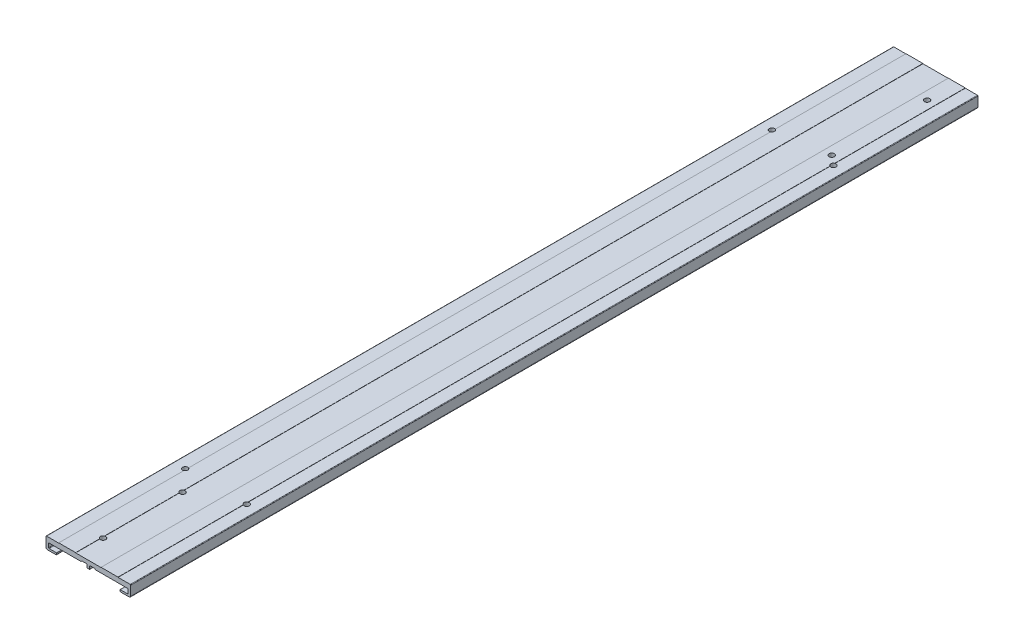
ISO-10303-21;
HEADER;
FILE_DESCRIPTION(('STEP AP214'),'2;1');
FILE_NAME('part.step','',(''),(''),'','','');
FILE_SCHEMA(('AUTOMOTIVE_DESIGN { 1 0 10303 214 1 1 1 1 }'));
ENDSEC;
DATA;
#1=APPLICATION_CONTEXT('core data for automotive mechanical design processes');
#2=APPLICATION_PROTOCOL_DEFINITION('international standard','automotive_design',2000,#1);
#3=PRODUCT_CONTEXT('',#1,'mechanical');
#4=PRODUCT('Part','Part','',(#3));
#5=PRODUCT_RELATED_PRODUCT_CATEGORY('part','',(#4));
#6=PRODUCT_DEFINITION_FORMATION('','',#4);
#7=PRODUCT_DEFINITION_CONTEXT('part definition',#1,'design');
#8=PRODUCT_DEFINITION('design','',#6,#7);
#9=PRODUCT_DEFINITION_SHAPE('','',#8);
#10=(LENGTH_UNIT() NAMED_UNIT(*) SI_UNIT(.MILLI.,.METRE.));
#11=(NAMED_UNIT(*) PLANE_ANGLE_UNIT() SI_UNIT($,.RADIAN.));
#12=(NAMED_UNIT(*) SI_UNIT($,.STERADIAN.) SOLID_ANGLE_UNIT());
#13=UNCERTAINTY_MEASURE_WITH_UNIT(LENGTH_MEASURE(1.E-05),#10,'distance_accuracy_value','');
#14=(GEOMETRIC_REPRESENTATION_CONTEXT(3) GLOBAL_UNCERTAINTY_ASSIGNED_CONTEXT((#13)) GLOBAL_UNIT_ASSIGNED_CONTEXT((#10,
#11,#12)) REPRESENTATION_CONTEXT('',''));
#15=CARTESIAN_POINT('',(0.,0.,0.));
#16=DIRECTION('',(0.,0.,1.));
#17=DIRECTION('',(1.,0.,0.));
#18=AXIS2_PLACEMENT_3D('',#15,#16,#17);
#19=CARTESIAN_POINT('',(45.5571831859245,190.211742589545,-213.));
#20=DIRECTION('',(1.,0.,0.));
#21=DIRECTION('',(0.,0.,-1.));
#22=AXIS2_PLACEMENT_3D('',#19,#20,#21);
#23=PLANE('',#22);
#24=DIRECTION('',(0.,1.,0.));
#25=VECTOR('',#24,1.);
#26=CARTESIAN_POINT('',(45.5571831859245,190.211742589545,667.));
#27=LINE('',#26,#25);
#28=CARTESIAN_POINT('',(45.5571831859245,191.031742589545,667.));
#29=VERTEX_POINT('',#28);
#30=CARTESIAN_POINT('',(45.5571831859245,190.831742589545,667.));
#31=VERTEX_POINT('',#30);
#32=EDGE_CURVE('E797',#29,#31,#27,.F.);
#33=ORIENTED_EDGE('',*,*,#32,.T.);
#34=DIRECTION('',(0.,0.,1.));
#35=VECTOR('',#34,1.);
#36=CARTESIAN_POINT('',(45.5571831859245,190.831742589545,-213.));
#37=LINE('',#36,#35);
#38=CARTESIAN_POINT('',(45.5571831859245,190.831742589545,548.777263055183));
#39=VERTEX_POINT('',#38);
#40=EDGE_CURVE('E663',#39,#31,#37,.T.);
#41=ORIENTED_EDGE('',*,*,#40,.F.);
#42=DIRECTION('',(0.,-1.,0.));
#43=VECTOR('',#42,1.);
#44=CARTESIAN_POINT('',(45.5571831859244,188.681692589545,548.777263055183));
#45=LINE('',#44,#43);
#46=CARTESIAN_POINT('',(45.5571831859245,191.031742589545,548.777263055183));
#47=VERTEX_POINT('',#46);
#48=EDGE_CURVE('E766',#47,#39,#45,.T.);
#49=ORIENTED_EDGE('',*,*,#48,.F.);
#50=DIRECTION('',(0.,0.,1.));
#51=VECTOR('',#50,1.);
#52=CARTESIAN_POINT('',(45.5571831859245,191.031742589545,667.));
#53=LINE('',#52,#51);
#54=EDGE_CURVE('E668',#29,#47,#53,.F.);
#55=ORIENTED_EDGE('',*,*,#54,.F.);
#56=EDGE_LOOP('',(#33,#41,#49,#55));
#57=FACE_BOUND('',#56,.T.);
#58=ADVANCED_FACE('F16',(#57),#23,.T.);
#59=CARTESIAN_POINT('',(45.5571831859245,190.831742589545,-133.));
#60=DIRECTION('',(1.,0.,0.));
#61=DIRECTION('',(0.,0.,-1.));
#62=AXIS2_PLACEMENT_3D('',#59,#60,#61);
#63=PLANE('',#62);
#64=DIRECTION('',(0.,1.,0.));
#65=VECTOR('',#64,1.);
#66=CARTESIAN_POINT('',(45.5571831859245,190.831742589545,-133.));
#67=LINE('',#66,#65);
#68=CARTESIAN_POINT('',(45.5571831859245,190.831742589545,-133.));
#69=VERTEX_POINT('',#68);
#70=CARTESIAN_POINT('',(45.5571831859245,191.031742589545,-133.));
#71=VERTEX_POINT('',#70);
#72=EDGE_CURVE('E433',#69,#71,#67,.T.);
#73=ORIENTED_EDGE('',*,*,#72,.T.);
#74=DIRECTION('',(0.,0.,1.));
#75=VECTOR('',#74,1.);
#76=CARTESIAN_POINT('',(45.5571831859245,191.031742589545,667.));
#77=LINE('',#76,#75);
#78=CARTESIAN_POINT('',(45.5571831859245,191.031742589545,-9.78183083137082));
#79=VERTEX_POINT('',#78);
#80=EDGE_CURVE('E675',#79,#71,#77,.F.);
#81=ORIENTED_EDGE('',*,*,#80,.F.);
#82=DIRECTION('',(0.,1.,0.));
#83=VECTOR('',#82,1.);
#84=CARTESIAN_POINT('',(45.5571831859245,188.681692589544,-9.78183083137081));
#85=LINE('',#84,#83);
#86=CARTESIAN_POINT('',(45.5571831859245,190.831742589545,-9.78183083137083));
#87=VERTEX_POINT('',#86);
#88=EDGE_CURVE('E793',#87,#79,#85,.T.);
#89=ORIENTED_EDGE('',*,*,#88,.F.);
#90=DIRECTION('',(0.,0.,1.));
#91=VECTOR('',#90,1.);
#92=CARTESIAN_POINT('',(45.5571831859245,190.831742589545,-213.));
#93=LINE('',#92,#91);
#94=EDGE_CURVE('E660',#69,#87,#93,.T.);
#95=ORIENTED_EDGE('',*,*,#94,.F.);
#96=EDGE_LOOP('',(#73,#81,#89,#95));
#97=FACE_BOUND('',#96,.T.);
#98=ADVANCED_FACE('F1201',(#97),#63,.T.);
#99=CARTESIAN_POINT('',(45.5571831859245,190.831742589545,-5.21816137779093));
#100=DIRECTION('',(1.,0.,0.));
#101=DIRECTION('',(0.,0.,-1.));
#102=AXIS2_PLACEMENT_3D('',#99,#100,#101);
#103=PLANE('',#102);
#104=DIRECTION('',(0.,-1.,0.));
#105=VECTOR('',#104,1.);
#106=CARTESIAN_POINT('',(45.5571831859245,188.681692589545,-5.21816137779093));
#107=LINE('',#106,#105);
#108=CARTESIAN_POINT('',(45.5571831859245,191.031742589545,-5.2181613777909));
#109=VERTEX_POINT('',#108);
#110=CARTESIAN_POINT('',(45.5571831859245,190.831742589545,-5.21816137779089));
#111=VERTEX_POINT('',#110);
#112=EDGE_CURVE('E790',#109,#111,#107,.T.);
#113=ORIENTED_EDGE('',*,*,#112,.F.);
#114=DIRECTION('',(0.,0.,1.));
#115=VECTOR('',#114,1.);
#116=CARTESIAN_POINT('',(45.5571831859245,191.031742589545,667.));
#117=LINE('',#116,#115);
#118=CARTESIAN_POINT('',(45.5571831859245,191.031742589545,544.222729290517));
#119=VERTEX_POINT('',#118);
#120=EDGE_CURVE('E679',#119,#109,#117,.F.);
#121=ORIENTED_EDGE('',*,*,#120,.F.);
#122=DIRECTION('',(0.,1.,0.));
#123=VECTOR('',#122,1.);
#124=CARTESIAN_POINT('',(45.5571831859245,188.681692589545,544.222729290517));
#125=LINE('',#124,#123);
#126=CARTESIAN_POINT('',(45.5571831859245,190.831742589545,544.222729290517));
#127=VERTEX_POINT('',#126);
#128=EDGE_CURVE('E792',#127,#119,#125,.T.);
#129=ORIENTED_EDGE('',*,*,#128,.F.);
#130=DIRECTION('',(0.,0.,1.));
#131=VECTOR('',#130,1.);
#132=CARTESIAN_POINT('',(45.5571831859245,190.831742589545,-213.));
#133=LINE('',#132,#131);
#134=EDGE_CURVE('E442',#111,#127,#133,.T.);
#135=ORIENTED_EDGE('',*,*,#134,.F.);
#136=EDGE_LOOP('',(#113,#121,#129,#135));
#137=FACE_BOUND('',#136,.T.);
#138=ADVANCED_FACE('F1198',(#137),#103,.T.);
#139=CARTESIAN_POINT('',(57.0571831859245,190.331742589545,747.));
#140=DIRECTION('',(-2.22044604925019E-13,-2.22044604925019E-13,-1.));
#141=DIRECTION('',(-1.,0.,2.22044604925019E-13));
#142=AXIS2_PLACEMENT_3D('',#139,#140,#141);
#143=CYLINDRICAL_SURFACE('',#142,0.499999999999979);
#144=CARTESIAN_POINT('',(57.0571831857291,190.33174258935,-133.));
#145=DIRECTION('',(-2.22044604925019E-13,-2.22044604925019E-13,-1.));
#146=DIRECTION('',(-1.,0.,2.22044604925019E-13));
#147=AXIS2_PLACEMENT_3D('',#144,#145,#146);
#148=CIRCLE('',#147,0.499999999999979);
#149=CARTESIAN_POINT('',(57.5571831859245,190.331742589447,-133.));
#150=VERTEX_POINT('',#149);
#151=CARTESIAN_POINT('',(57.0571831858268,190.831742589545,-133.));
#152=VERTEX_POINT('',#151);
#153=EDGE_CURVE('E432',#150,#152,#148,.F.);
#154=ORIENTED_EDGE('',*,*,#153,.T.);
#155=DIRECTION('',(0.,0.,1.));
#156=VECTOR('',#155,1.);
#157=CARTESIAN_POINT('',(57.0571831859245,190.831742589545,-213.));
#158=LINE('',#157,#156);
#159=CARTESIAN_POINT('',(57.0571831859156,190.831742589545,667.));
#160=VERTEX_POINT('',#159);
#161=EDGE_CURVE('E430',#160,#152,#158,.F.);
#162=ORIENTED_EDGE('',*,*,#161,.F.);
#163=CARTESIAN_POINT('',(57.0571831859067,190.331742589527,667.));
#164=DIRECTION('',(-2.22044604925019E-13,-2.22044604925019E-13,-1.));
#165=DIRECTION('',(-1.,0.,2.22044604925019E-13));
#166=AXIS2_PLACEMENT_3D('',#163,#164,#165);
#167=CIRCLE('',#166,0.499999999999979);
#168=CARTESIAN_POINT('',(57.5571831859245,190.331742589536,667.));
#169=VERTEX_POINT('',#168);
#170=EDGE_CURVE('E20',#160,#169,#167,.T.);
#171=ORIENTED_EDGE('',*,*,#170,.T.);
#172=DIRECTION('',(0.,0.,-1.));
#173=VECTOR('',#172,1.);
#174=CARTESIAN_POINT('',(57.5571831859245,190.331742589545,-213.));
#175=LINE('',#174,#173);
#176=EDGE_CURVE('E427',#150,#169,#175,.F.);
#177=ORIENTED_EDGE('',*,*,#176,.F.);
#178=EDGE_LOOP('',(#154,#162,#171,#177));
#179=FACE_BOUND('',#178,.T.);
#180=ADVANCED_FACE('F426',(#179),#143,.T.);
#181=CARTESIAN_POINT('',(48.0571831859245,180.531642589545,544.476732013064));
#182=DIRECTION('',(2.22089022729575E-13,2.22089022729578E-13,-1.));
#183=DIRECTION('',(0.,1.,2.22089022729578E-13));
#184=AXIS2_PLACEMENT_3D('',#181,#182,#183);
#185=CYLINDRICAL_SURFACE('',#184,0.499899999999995);
#186=CARTESIAN_POINT('',(48.0571831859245,180.031742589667,-5.48413351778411));
#187=CARTESIAN_POINT('',(48.0400285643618,180.031747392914,-5.47154970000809));
#188=CARTESIAN_POINT('',(48.0227198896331,180.032627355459,-5.45919284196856));
#189=CARTESIAN_POINT('',(47.9878954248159,180.036255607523,-5.43498952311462));
#190=CARTESIAN_POINT('',(47.9703793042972,180.039007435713,-5.42314407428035));
#191=CARTESIAN_POINT('',(47.9176954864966,180.050259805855,-5.38848093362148));
#192=CARTESIAN_POINT('',(47.8824673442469,180.061758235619,-5.36659132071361));
#193=CARTESIAN_POINT('',(47.8238927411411,180.088702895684,-5.33205262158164));
#194=CARTESIAN_POINT('',(47.800056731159,180.102045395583,-5.31856205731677));
#195=CARTESIAN_POINT('',(47.7542706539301,180.133014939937,-5.29355034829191));
#196=CARTESIAN_POINT('',(47.7323158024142,180.150630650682,-5.28202412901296));
#197=CARTESIAN_POINT('',(47.6910787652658,180.190049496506,-5.26105356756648));
#198=CARTESIAN_POINT('',(47.6718122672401,180.211875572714,-5.25162126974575));
#199=CARTESIAN_POINT('',(47.6370522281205,180.259153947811,-5.23504859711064));
#200=CARTESIAN_POINT('',(47.621560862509,180.284608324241,-5.22790954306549));
#201=CARTESIAN_POINT('',(47.5964101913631,180.335864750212,-5.21653945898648));
#202=CARTESIAN_POINT('',(47.5863489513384,180.361425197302,-5.21210318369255));
#203=CARTESIAN_POINT('',(47.5705320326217,180.414072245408,-5.20520061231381));
#204=CARTESIAN_POINT('',(47.564768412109,180.441155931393,-5.20273068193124));
#205=CARTESIAN_POINT('',(47.5599493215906,180.479006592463,-5.20067115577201));
#206=CARTESIAN_POINT('',(47.5589494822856,180.489513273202,-5.20024484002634));
#207=CARTESIAN_POINT('',(47.5576172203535,180.510559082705,-5.19967735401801));
#208=CARTESIAN_POINT('',(47.5572836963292,180.521098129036,-5.19953571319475));
#209=CARTESIAN_POINT('',(47.5572831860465,180.53164258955,-5.19953532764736));
#210=B_SPLINE_CURVE_WITH_KNOTS('',3,(#186,#187,#188,#189,#190,#191,#192,#193,#194,#195,#196,
#197,#198,#199,#200,#201,#202,#203,#204,#205,#206,#207,#208,#209),.UNSPECIFIED.,.F.,.F.,(4,2,2,
2,2,2,2,2,2,2,2,4),(0.,0.0637802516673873,0.127681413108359,0.255758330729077,0.34679133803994,
0.437585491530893,0.528889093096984,0.620245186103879,0.703302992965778,0.786206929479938,
0.817875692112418,0.849492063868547),.UNSPECIFIED.);
#211=CARTESIAN_POINT('',(48.0571831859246,180.031742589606,-5.48413351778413));
#212=VERTEX_POINT('',#211);
#213=CARTESIAN_POINT('',(47.5572831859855,180.531642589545,-5.19953532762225));
#214=VERTEX_POINT('',#213);
#215=EDGE_CURVE('E774',#212,#214,#210,.T.);
#216=ORIENTED_EDGE('',*,*,#215,.F.);
#217=DIRECTION('',(0.,0.,-1.));
#218=VECTOR('',#217,1.);
#219=CARTESIAN_POINT('',(48.0571831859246,180.031742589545,-213.));
#220=LINE('',#219,#218);
#221=CARTESIAN_POINT('',(48.0571831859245,180.031742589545,544.476732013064));
#222=VERTEX_POINT('',#221);
#223=EDGE_CURVE('E652',#222,#212,#220,.T.);
#224=ORIENTED_EDGE('',*,*,#223,.F.);
#225=CARTESIAN_POINT('',(47.5572831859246,180.531642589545,544.195245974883));
#226=CARTESIAN_POINT('',(47.557252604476,180.505360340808,544.19524601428));
#227=CARTESIAN_POINT('',(47.5593538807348,180.479091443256,544.196116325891));
#228=CARTESIAN_POINT('',(47.5675885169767,180.427369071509,544.199596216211));
#229=CARTESIAN_POINT('',(47.5737130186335,180.401913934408,544.202201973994));
#230=CARTESIAN_POINT('',(47.5897650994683,180.352483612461,544.209151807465));
#231=CARTESIAN_POINT('',(47.5996930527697,180.328508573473,544.213496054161));
#232=CARTESIAN_POINT('',(47.622934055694,180.282669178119,544.223913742));
#233=CARTESIAN_POINT('',(47.6362477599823,180.260805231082,544.22998751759));
#234=CARTESIAN_POINT('',(47.6660160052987,180.219307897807,544.24396109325));
#235=CARTESIAN_POINT('',(47.6825260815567,180.199725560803,544.251893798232));
#236=CARTESIAN_POINT('',(47.7178667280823,180.163672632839,544.269435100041));
#237=CARTESIAN_POINT('',(47.7366970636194,180.147201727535,544.279043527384));
#238=CARTESIAN_POINT('',(47.77733063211,180.11658598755,544.300507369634));
#239=CARTESIAN_POINT('',(47.7992482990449,180.102668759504,544.312469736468));
#240=CARTESIAN_POINT('',(47.8442548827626,180.078636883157,544.337985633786));
#241=CARTESIAN_POINT('',(47.8673458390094,180.068529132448,544.351541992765));
#242=CARTESIAN_POINT('',(47.9183617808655,180.050507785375,544.382668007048));
#243=CARTESIAN_POINT('',(47.9463844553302,180.043356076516,544.400514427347));
#244=CARTESIAN_POINT('',(48.0021634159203,180.033975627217,544.437640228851));
#245=CARTESIAN_POINT('',(48.0299203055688,180.03172864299,544.456914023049));
#246=CARTESIAN_POINT('',(48.0571831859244,180.031742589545,544.476732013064));
#247=B_SPLINE_CURVE_WITH_KNOTS('',3,(#225,#226,#227,#228,#229,#230,#231,#232,#233,#234,#235,
#236,#237,#238,#239,#240,#241,#242,#243,#244,#245,#246),.UNSPECIFIED.,.F.,.F.,(4,2,2,2,2,2,2,2,
2,2,4),(0.,0.0787281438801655,0.15728352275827,0.235846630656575,0.31442494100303,
0.39451611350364,0.474599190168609,0.560009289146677,0.645573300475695,0.747110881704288,
0.848270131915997),.UNSPECIFIED.);
#248=CARTESIAN_POINT('',(47.5572831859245,180.531642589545,544.195245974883));
#249=VERTEX_POINT('',#248);
#250=EDGE_CURVE('E1024',#249,#222,#247,.T.);
#251=ORIENTED_EDGE('',*,*,#250,.F.);
#252=DIRECTION('',(0.,0.,1.));
#253=VECTOR('',#252,1.);
#254=CARTESIAN_POINT('',(47.5572831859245,180.531642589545,-5.19953532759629));
#255=LINE('',#254,#253);
#256=EDGE_CURVE('E770',#214,#249,#255,.T.);
#257=ORIENTED_EDGE('',*,*,#256,.F.);
#258=EDGE_LOOP('',(#216,#224,#251,#257));
#259=FACE_BOUND('',#258,.T.);
#260=ADVANCED_FACE('F1013',(#259),#185,.T.);
#261=CARTESIAN_POINT('',(48.0571831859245,180.531642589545,-9.51585869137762));
#262=DIRECTION('',(0.,0.,-1.));
#263=DIRECTION('',(-1.,0.,0.));
#264=AXIS2_PLACEMENT_3D('',#261,#262,#263);
#265=CYLINDRICAL_SURFACE('',#264,0.499899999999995);
#266=CARTESIAN_POINT('',(48.0571831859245,180.531642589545,-133.));
#267=DIRECTION('',(0.,0.,-1.));
#268=DIRECTION('',(-1.,0.,0.));
#269=AXIS2_PLACEMENT_3D('',#266,#267,#268);
#270=CIRCLE('',#269,0.499899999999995);
#271=CARTESIAN_POINT('',(47.5572831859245,180.531642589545,-133.));
#272=VERTEX_POINT('',#271);
#273=CARTESIAN_POINT('',(48.0571831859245,180.031742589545,-133.));
#274=VERTEX_POINT('',#273);
#275=EDGE_CURVE('E1806',#272,#274,#270,.F.);
#276=ORIENTED_EDGE('',*,*,#275,.T.);
#277=DIRECTION('',(0.,0.,-1.));
#278=VECTOR('',#277,1.);
#279=CARTESIAN_POINT('',(48.0571831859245,180.031742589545,-213.));
#280=LINE('',#279,#278);
#281=CARTESIAN_POINT('',(48.0571831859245,180.031742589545,-9.51585869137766));
#282=VERTEX_POINT('',#281);
#283=EDGE_CURVE('E648',#282,#274,#280,.T.);
#284=ORIENTED_EDGE('',*,*,#283,.F.);
#285=CARTESIAN_POINT('',(47.5572831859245,180.531642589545,-9.80045688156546));
#286=CARTESIAN_POINT('',(47.5572524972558,180.505397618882,-9.80045705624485));
#287=CARTESIAN_POINT('',(47.5593479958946,180.479166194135,-9.79957828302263));
#288=CARTESIAN_POINT('',(47.5675587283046,180.427519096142,-9.79606579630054));
#289=CARTESIAN_POINT('',(47.5736649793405,180.402101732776,-9.7934360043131));
#290=CARTESIAN_POINT('',(47.589667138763,180.352745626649,-9.78642413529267));
#291=CARTESIAN_POINT('',(47.5995633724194,180.328807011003,-9.78204190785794));
#292=CARTESIAN_POINT('',(47.6227266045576,180.283036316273,-9.77153708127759));
#293=CARTESIAN_POINT('',(47.6359942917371,180.261204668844,-9.76541412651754));
#294=CARTESIAN_POINT('',(47.6656621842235,180.219755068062,-9.75132979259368));
#295=CARTESIAN_POINT('',(47.6821190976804,180.200189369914,-9.74333448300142));
#296=CARTESIAN_POINT('',(47.7173410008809,180.164161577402,-9.72566178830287));
#297=CARTESIAN_POINT('',(47.7361057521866,180.147699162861,-9.71598457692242));
#298=CARTESIAN_POINT('',(47.7766217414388,180.117066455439,-9.69435979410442));
#299=CARTESIAN_POINT('',(47.7984892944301,180.103128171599,-9.68230258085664));
#300=CARTESIAN_POINT('',(47.8433893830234,180.07904667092,-9.65659157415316));
#301=CARTESIAN_POINT('',(47.8664239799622,180.068910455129,-9.64293489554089));
#302=CARTESIAN_POINT('',(47.9175515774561,180.050729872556,-9.61143821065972));
#303=CARTESIAN_POINT('',(47.9457471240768,180.043490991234,-9.59330409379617));
#304=CARTESIAN_POINT('',(48.0018582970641,180.033999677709,-9.55557934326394));
#305=CARTESIAN_POINT('',(48.0297745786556,180.031728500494,-9.5359944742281));
#306=CARTESIAN_POINT('',(48.0571831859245,180.031742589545,-9.51585869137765));
#307=B_SPLINE_CURVE_WITH_KNOTS('',3,(#285,#286,#287,#288,#289,#290,#291,#292,#293,#294,#295,
#296,#297,#298,#299,#300,#301,#302,#303,#304,#305,#306),.UNSPECIFIED.,.F.,.F.,(4,2,2,2,2,2,2,2,
2,2,4),(0.,0.0786160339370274,0.157056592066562,0.235503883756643,0.313967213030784,
0.393980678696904,0.473985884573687,0.559431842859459,0.645034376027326,0.747500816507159,
0.849579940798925),.UNSPECIFIED.);
#308=CARTESIAN_POINT('',(47.5572831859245,180.531642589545,-9.80045688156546));
#309=VERTEX_POINT('',#308);
#310=EDGE_CURVE('E778',#309,#282,#307,.T.);
#311=ORIENTED_EDGE('',*,*,#310,.F.);
#312=DIRECTION('',(0.,0.,1.));
#313=VECTOR('',#312,1.);
#314=CARTESIAN_POINT('',(47.5572831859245,180.531642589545,-133.));
#315=LINE('',#314,#313);
#316=EDGE_CURVE('E779',#272,#309,#315,.T.);
#317=ORIENTED_EDGE('',*,*,#316,.F.);
#318=EDGE_LOOP('',(#276,#284,#311,#317));
#319=FACE_BOUND('',#318,.T.);
#320=ADVANCED_FACE('F1017',(#319),#265,.T.);
#321=CARTESIAN_POINT('',(48.0571831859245,180.531642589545,747.));
#322=DIRECTION('',(2.22089022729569E-13,2.22089022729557E-13,-1.));
#323=DIRECTION('',(-1.,0.,-2.22089022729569E-13));
#324=AXIS2_PLACEMENT_3D('',#321,#322,#323);
#325=CYLINDRICAL_SURFACE('',#324,0.499900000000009);
#326=CARTESIAN_POINT('',(48.0571831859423,180.531642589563,667.));
#327=DIRECTION('',(2.22089022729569E-13,2.22089022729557E-13,-1.));
#328=DIRECTION('',(-1.,0.,-2.22089022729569E-13));
#329=AXIS2_PLACEMENT_3D('',#326,#327,#328);
#330=CIRCLE('',#329,0.499900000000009);
#331=CARTESIAN_POINT('',(48.0571831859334,180.031742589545,667.));
#332=VERTEX_POINT('',#331);
#333=CARTESIAN_POINT('',(47.5572831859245,180.531642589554,667.));
#334=VERTEX_POINT('',#333);
#335=EDGE_CURVE('E1031',#332,#334,#330,.T.);
#336=ORIENTED_EDGE('',*,*,#335,.T.);
#337=DIRECTION('',(0.,0.,1.));
#338=VECTOR('',#337,1.);
#339=CARTESIAN_POINT('',(47.5572831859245,180.531642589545,-213.));
#340=LINE('',#339,#338);
#341=CARTESIAN_POINT('',(47.5572831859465,180.531642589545,548.804746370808));
#342=VERTEX_POINT('',#341);
#343=EDGE_CURVE('E787',#342,#334,#340,.T.);
#344=ORIENTED_EDGE('',*,*,#343,.F.);
#345=CARTESIAN_POINT('',(48.0571831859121,180.031742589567,548.523260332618));
#346=CARTESIAN_POINT('',(48.0399589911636,180.031747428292,548.535762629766));
#347=CARTESIAN_POINT('',(48.0225818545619,180.032634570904,548.548036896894));
#348=CARTESIAN_POINT('',(47.9876247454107,180.03629112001,548.572072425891));
#349=CARTESIAN_POINT('',(47.9700444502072,180.039064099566,548.583832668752));
#350=CARTESIAN_POINT('',(47.9171841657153,180.050399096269,548.618231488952));
#351=CARTESIAN_POINT('',(47.8818539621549,180.061978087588,548.639938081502));
#352=CARTESIAN_POINT('',(47.8232121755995,180.089061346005,548.674120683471));
#353=CARTESIAN_POINT('',(47.7993954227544,180.102442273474,548.687444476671));
#354=CARTESIAN_POINT('',(47.7536666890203,180.1334750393,548.712134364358));
#355=CARTESIAN_POINT('',(47.7317498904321,180.151115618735,548.723505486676));
#356=CARTESIAN_POINT('',(47.6906051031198,180.190560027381,548.744182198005));
#357=CARTESIAN_POINT('',(47.6713925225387,180.212386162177,548.753476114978));
#358=CARTESIAN_POINT('',(47.6367419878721,180.259637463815,548.769799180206));
#359=CARTESIAN_POINT('',(47.6213062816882,180.285064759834,548.776826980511));
#360=CARTESIAN_POINT('',(47.5962270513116,180.336295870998,548.788027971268));
#361=CARTESIAN_POINT('',(47.5861904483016,180.361865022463,548.792399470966));
#362=CARTESIAN_POINT('',(47.5704246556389,180.414518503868,548.799195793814));
#363=CARTESIAN_POINT('',(47.5646875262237,180.441599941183,548.801624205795));
#364=CARTESIAN_POINT('',(47.5599122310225,180.479373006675,548.803640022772));
#365=CARTESIAN_POINT('',(47.5589262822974,180.489807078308,548.804055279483));
#366=CARTESIAN_POINT('',(47.5576125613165,180.510706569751,548.804608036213));
#367=CARTESIAN_POINT('',(47.5572837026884,180.521171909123,548.804745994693));
#368=CARTESIAN_POINT('',(47.5572831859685,180.531642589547,548.804746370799));
#369=B_SPLINE_CURVE_WITH_KNOTS('',3,(#345,#346,#347,#348,#349,#350,#351,#352,#353,#354,#355,
#356,#357,#358,#359,#360,#361,#362,#363,#364,#365,#366,#367,#368),.UNSPECIFIED.,.F.,.F.,(4,2,2,
2,2,2,2,2,2,2,2,4),(0.,0.0638040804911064,0.127729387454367,0.255832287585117,0.346650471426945,
0.437231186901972,0.528308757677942,0.61944040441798,0.702466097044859,0.785338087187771,
0.816785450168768,0.84818077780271),.UNSPECIFIED.);
#370=CARTESIAN_POINT('',(48.0571831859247,180.031742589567,548.523260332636));
#371=VERTEX_POINT('',#370);
#372=EDGE_CURVE('E788',#371,#342,#369,.T.);
#373=ORIENTED_EDGE('',*,*,#372,.F.);
#374=DIRECTION('',(0.,0.,-1.));
#375=VECTOR('',#374,1.);
#376=CARTESIAN_POINT('',(48.0571831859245,180.031742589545,-213.));
#377=LINE('',#376,#375);
#378=EDGE_CURVE('E643',#332,#371,#377,.T.);
#379=ORIENTED_EDGE('',*,*,#378,.F.);
#380=EDGE_LOOP('',(#336,#344,#373,#379));
#381=FACE_BOUND('',#380,.T.);
#382=ADVANCED_FACE('F1037',(#381),#325,.T.);
#383=CARTESIAN_POINT('',(46.5887138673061,180.013742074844,546.49999617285));
#384=DIRECTION('',(0.,1.,0.));
#385=DIRECTION('',(0.,0.,1.));
#386=AXIS2_PLACEMENT_3D('',#383,#384,#385);
#387=CYLINDRICAL_SURFACE('',#386,2.49999999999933);
#388=CARTESIAN_POINT('',(46.5887138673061,181.831642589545,546.49999617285));
#389=DIRECTION('',(0.,1.,0.));
#390=DIRECTION('',(0.,0.,1.));
#391=AXIS2_PLACEMENT_3D('',#388,#389,#390);
#392=CIRCLE('',#391,2.49999999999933);
#393=CARTESIAN_POINT('',(47.5572831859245,181.831642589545,544.195245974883));
#394=VERTEX_POINT('',#393);
#395=CARTESIAN_POINT('',(47.5572831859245,181.831642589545,548.804746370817));
#396=VERTEX_POINT('',#395);
#397=EDGE_CURVE('E640',#394,#396,#392,.F.);
#398=ORIENTED_EDGE('',*,*,#397,.F.);
#399=DIRECTION('',(0.,1.,0.));
#400=VECTOR('',#399,1.);
#401=CARTESIAN_POINT('',(47.5572831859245,181.831642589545,544.195245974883));
#402=LINE('',#401,#400);
#403=EDGE_CURVE('E771',#249,#394,#402,.T.);
#404=ORIENTED_EDGE('',*,*,#403,.F.);
#405=ORIENTED_EDGE('',*,*,#250,.T.);
#406=CARTESIAN_POINT('',(46.5887138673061,180.031742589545,546.49999617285));
#407=DIRECTION('',(0.,1.,0.));
#408=DIRECTION('',(0.,0.,1.));
#409=AXIS2_PLACEMENT_3D('',#406,#407,#408);
#410=CIRCLE('',#409,2.49999999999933);
#411=EDGE_CURVE('E646',#371,#222,#410,.T.);
#412=ORIENTED_EDGE('',*,*,#411,.F.);
#413=ORIENTED_EDGE('',*,*,#372,.T.);
#414=DIRECTION('',(0.,1.,0.));
#415=VECTOR('',#414,1.);
#416=CARTESIAN_POINT('',(47.5572831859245,181.961642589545,548.804746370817));
#417=LINE('',#416,#415);
#418=EDGE_CURVE('E784',#396,#342,#417,.F.);
#419=ORIENTED_EDGE('',*,*,#418,.F.);
#420=EDGE_LOOP('',(#398,#404,#405,#412,#413,#419));
#421=FACE_BOUND('',#420,.T.);
#422=ADVANCED_FACE('F1039',(#421),#387,.F.);
#423=CARTESIAN_POINT('',(47.5572831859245,181.961642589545,-213.));
#424=DIRECTION('',(-1.,0.,0.));
#425=DIRECTION('',(0.,0.,1.));
#426=AXIS2_PLACEMENT_3D('',#423,#424,#425);
#427=PLANE('',#426);
#428=DIRECTION('',(0.,1.,0.));
#429=VECTOR('',#428,1.);
#430=CARTESIAN_POINT('',(47.5572831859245,181.961642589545,667.));
#431=LINE('',#430,#429);
#432=CARTESIAN_POINT('',(47.5572831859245,181.831642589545,667.));
#433=VERTEX_POINT('',#432);
#434=EDGE_CURVE('E783',#334,#433,#431,.T.);
#435=ORIENTED_EDGE('',*,*,#434,.T.);
#436=DIRECTION('',(0.,0.,1.));
#437=VECTOR('',#436,1.);
#438=CARTESIAN_POINT('',(47.5572831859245,181.831642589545,-213.));
#439=LINE('',#438,#437);
#440=EDGE_CURVE('E637',#396,#433,#439,.T.);
#441=ORIENTED_EDGE('',*,*,#440,.F.);
#442=ORIENTED_EDGE('',*,*,#418,.T.);
#443=ORIENTED_EDGE('',*,*,#343,.T.);
#444=EDGE_LOOP('',(#435,#441,#442,#443));
#445=FACE_BOUND('',#444,.T.);
#446=ADVANCED_FACE('F1042',(#445),#427,.T.);
#447=CARTESIAN_POINT('',(47.5572831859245,181.831642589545,-133.));
#448=DIRECTION('',(-1.,0.,0.));
#449=DIRECTION('',(0.,0.,1.));
#450=AXIS2_PLACEMENT_3D('',#447,#448,#449);
#451=PLANE('',#450);
#452=DIRECTION('',(0.,1.,0.));
#453=VECTOR('',#452,1.);
#454=CARTESIAN_POINT('',(47.5572831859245,181.831642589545,-133.));
#455=LINE('',#454,#453);
#456=CARTESIAN_POINT('',(47.5572831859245,181.831642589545,-133.));
#457=VERTEX_POINT('',#456);
#458=EDGE_CURVE('E780',#457,#272,#455,.F.);
#459=ORIENTED_EDGE('',*,*,#458,.T.);
#460=ORIENTED_EDGE('',*,*,#316,.T.);
#461=DIRECTION('',(0.,-1.,0.));
#462=VECTOR('',#461,1.);
#463=CARTESIAN_POINT('',(47.5572831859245,180.922692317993,-9.80045688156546));
#464=LINE('',#463,#462);
#465=CARTESIAN_POINT('',(47.5572831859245,181.831642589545,-9.80045688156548));
#466=VERTEX_POINT('',#465);
#467=EDGE_CURVE('E775',#466,#309,#464,.T.);
#468=ORIENTED_EDGE('',*,*,#467,.F.);
#469=DIRECTION('',(0.,0.,1.));
#470=VECTOR('',#469,1.);
#471=CARTESIAN_POINT('',(47.5572831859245,181.831642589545,-213.));
#472=LINE('',#471,#470);
#473=EDGE_CURVE('E633',#457,#466,#472,.T.);
#474=ORIENTED_EDGE('',*,*,#473,.F.);
#475=EDGE_LOOP('',(#459,#460,#468,#474));
#476=FACE_BOUND('',#475,.T.);
#477=ADVANCED_FACE('F996',(#476),#451,.T.);
#478=CARTESIAN_POINT('',(46.578569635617,180.01374204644,-7.49999610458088));
#479=DIRECTION('',(0.,1.,0.));
#480=DIRECTION('',(-1.,0.,0.));
#481=AXIS2_PLACEMENT_3D('',#478,#479,#480);
#482=CYLINDRICAL_SURFACE('',#481,2.50000000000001);
#483=CARTESIAN_POINT('',(46.578569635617,181.831642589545,-7.49999610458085));
#484=DIRECTION('',(0.,1.,0.));
#485=DIRECTION('',(-1.,0.,0.));
#486=AXIS2_PLACEMENT_3D('',#483,#484,#485);
#487=CIRCLE('',#486,2.50000000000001);
#488=CARTESIAN_POINT('',(47.5572831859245,181.831642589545,-5.19953532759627));
#489=VERTEX_POINT('',#488);
#490=EDGE_CURVE('E632',#466,#489,#487,.F.);
#491=ORIENTED_EDGE('',*,*,#490,.F.);
#492=ORIENTED_EDGE('',*,*,#467,.T.);
#493=ORIENTED_EDGE('',*,*,#310,.T.);
#494=CARTESIAN_POINT('',(46.578569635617,180.031742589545,-7.49999610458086));
#495=DIRECTION('',(0.,1.,0.));
#496=DIRECTION('',(-1.,0.,0.));
#497=AXIS2_PLACEMENT_3D('',#494,#495,#496);
#498=CIRCLE('',#497,2.50000000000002);
#499=EDGE_CURVE('E651',#212,#282,#498,.T.);
#500=ORIENTED_EDGE('',*,*,#499,.F.);
#501=ORIENTED_EDGE('',*,*,#215,.T.);
#502=DIRECTION('',(0.,1.,0.));
#503=VECTOR('',#502,1.);
#504=CARTESIAN_POINT('',(47.5572831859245,181.831642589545,-5.19953532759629));
#505=LINE('',#504,#503);
#506=EDGE_CURVE('E767',#489,#214,#505,.F.);
#507=ORIENTED_EDGE('',*,*,#506,.F.);
#508=EDGE_LOOP('',(#491,#492,#493,#500,#501,#507));
#509=FACE_BOUND('',#508,.T.);
#510=ADVANCED_FACE('F992',(#509),#482,.F.);
#511=CARTESIAN_POINT('',(47.5572831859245,181.831642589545,-5.19953532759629));
#512=DIRECTION('',(-1.,0.,0.));
#513=DIRECTION('',(0.,0.,1.));
#514=AXIS2_PLACEMENT_3D('',#511,#512,#513);
#515=PLANE('',#514);
#516=ORIENTED_EDGE('',*,*,#506,.T.);
#517=ORIENTED_EDGE('',*,*,#256,.T.);
#518=ORIENTED_EDGE('',*,*,#403,.T.);
#519=DIRECTION('',(0.,0.,1.));
#520=VECTOR('',#519,1.);
#521=CARTESIAN_POINT('',(47.5572831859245,181.831642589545,-213.));
#522=LINE('',#521,#520);
#523=EDGE_CURVE('E629',#489,#394,#522,.T.);
#524=ORIENTED_EDGE('',*,*,#523,.F.);
#525=EDGE_LOOP('',(#516,#517,#518,#524));
#526=FACE_BOUND('',#525,.T.);
#527=ADVANCED_FACE('F990',(#526),#515,.T.);
#528=CARTESIAN_POINT('',(54.5571831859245,182.331642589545,747.));
#529=DIRECTION('',(2.22044604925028E-13,2.22044604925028E-13,-1.));
#530=DIRECTION('',(-1.,0.,-2.22044604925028E-13));
#531=AXIS2_PLACEMENT_3D('',#528,#529,#530);
#532=CYLINDRICAL_SURFACE('',#531,0.500000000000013);
#533=DIRECTION('',(0.,0.,1.));
#534=VECTOR('',#533,1.);
#535=CARTESIAN_POINT('',(54.5571831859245,181.831642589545,-213.));
#536=LINE('',#535,#534);
#537=CARTESIAN_POINT('',(54.5571831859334,181.831642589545,667.));
#538=VERTEX_POINT('',#537);
#539=CARTESIAN_POINT('',(54.5571831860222,181.831642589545,-133.));
#540=VERTEX_POINT('',#539);
#541=EDGE_CURVE('E636',#538,#540,#536,.F.);
#542=ORIENTED_EDGE('',*,*,#541,.F.);
#543=CARTESIAN_POINT('',(54.5571831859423,182.331642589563,667.));
#544=DIRECTION('',(2.22044604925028E-13,2.22044604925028E-13,-1.));
#545=DIRECTION('',(-1.,0.,-2.22044604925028E-13));
#546=AXIS2_PLACEMENT_3D('',#543,#544,#545);
#547=CIRCLE('',#546,0.500000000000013);
#548=CARTESIAN_POINT('',(55.0571831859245,182.331642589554,667.));
#549=VERTEX_POINT('',#548);
#550=EDGE_CURVE('E1272',#538,#549,#547,.F.);
#551=ORIENTED_EDGE('',*,*,#550,.T.);
#552=DIRECTION('',(0.,0.,1.));
#553=VECTOR('',#552,1.);
#554=CARTESIAN_POINT('',(55.0571831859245,182.331642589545,-213.));
#555=LINE('',#554,#553);
#556=CARTESIAN_POINT('',(55.0571831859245,182.331642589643,-133.));
#557=VERTEX_POINT('',#556);
#558=EDGE_CURVE('E623',#557,#549,#555,.T.);
#559=ORIENTED_EDGE('',*,*,#558,.F.);
#560=CARTESIAN_POINT('',(54.5571831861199,182.33164258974,-133.));
#561=DIRECTION('',(2.22044604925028E-13,2.22044604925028E-13,-1.));
#562=DIRECTION('',(-1.,0.,-2.22044604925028E-13));
#563=AXIS2_PLACEMENT_3D('',#560,#561,#562);
#564=CIRCLE('',#563,0.500000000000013);
#565=EDGE_CURVE('E808',#557,#540,#564,.T.);
#566=ORIENTED_EDGE('',*,*,#565,.T.);
#567=EDGE_LOOP('',(#542,#551,#559,#566));
#568=FACE_BOUND('',#567,.T.);
#569=ADVANCED_FACE('F986',(#568),#532,.F.);
#570=CARTESIAN_POINT('',(54.5571831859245,185.831642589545,747.));
#571=DIRECTION('',(-2.22044604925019E-13,-2.22044604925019E-13,-1.));
#572=DIRECTION('',(-1.,0.,2.22044604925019E-13));
#573=AXIS2_PLACEMENT_3D('',#570,#571,#572);
#574=CYLINDRICAL_SURFACE('',#573,0.499999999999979);
#575=DIRECTION('',(0.,0.,1.));
#576=VECTOR('',#575,1.);
#577=CARTESIAN_POINT('',(55.0571831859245,185.831642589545,-213.));
#578=LINE('',#577,#576);
#579=CARTESIAN_POINT('',(55.0571831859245,185.831642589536,667.));
#580=VERTEX_POINT('',#579);
#581=CARTESIAN_POINT('',(55.0571831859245,185.831642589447,-133.));
#582=VERTEX_POINT('',#581);
#583=EDGE_CURVE('E626',#580,#582,#578,.F.);
#584=ORIENTED_EDGE('',*,*,#583,.F.);
#585=CARTESIAN_POINT('',(54.5571831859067,185.831642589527,667.));
#586=DIRECTION('',(-2.22044604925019E-13,-2.22044604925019E-13,-1.));
#587=DIRECTION('',(-1.,0.,2.22044604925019E-13));
#588=AXIS2_PLACEMENT_3D('',#585,#586,#587);
#589=CIRCLE('',#588,0.499999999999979);
#590=CARTESIAN_POINT('',(54.5571831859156,186.331642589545,667.));
#591=VERTEX_POINT('',#590);
#592=EDGE_CURVE('E795',#580,#591,#589,.F.);
#593=ORIENTED_EDGE('',*,*,#592,.T.);
#594=DIRECTION('',(0.,0.,-1.));
#595=VECTOR('',#594,1.);
#596=CARTESIAN_POINT('',(54.5571831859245,186.331642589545,667.));
#597=LINE('',#596,#595);
#598=CARTESIAN_POINT('',(54.5571831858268,186.331642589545,-133.));
#599=VERTEX_POINT('',#598);
#600=EDGE_CURVE('E616',#599,#591,#597,.F.);
#601=ORIENTED_EDGE('',*,*,#600,.F.);
#602=CARTESIAN_POINT('',(54.5571831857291,185.83164258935,-133.));
#603=DIRECTION('',(-2.22044604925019E-13,-2.22044604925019E-13,-1.));
#604=DIRECTION('',(-1.,0.,2.22044604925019E-13));
#605=AXIS2_PLACEMENT_3D('',#602,#603,#604);
#606=CIRCLE('',#605,0.499999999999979);
#607=EDGE_CURVE('E1271',#599,#582,#606,.T.);
#608=ORIENTED_EDGE('',*,*,#607,.T.);
#609=EDGE_LOOP('',(#584,#593,#601,#608));
#610=FACE_BOUND('',#609,.T.);
#611=ADVANCED_FACE('F982',(#610),#574,.F.);
#612=CARTESIAN_POINT('',(37.5571831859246,186.331642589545,-14.9499999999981));
#613=DIRECTION('',(0.,1.,0.));
#614=DIRECTION('',(0.,0.,1.));
#615=AXIS2_PLACEMENT_3D('',#612,#613,#614);
#616=CYLINDRICAL_SURFACE('',#615,2.5);
#617=CARTESIAN_POINT('',(37.5571831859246,191.031742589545,-14.9499999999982));
#618=DIRECTION('',(0.,1.,0.));
#619=DIRECTION('',(-1.,0.,0.));
#620=AXIS2_PLACEMENT_3D('',#617,#618,#619);
#621=CIRCLE('',#620,2.50000000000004);
#622=CARTESIAN_POINT('',(35.0571831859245,191.031742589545,-14.9499999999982));
#623=VERTEX_POINT('',#622);
#624=EDGE_CURVE('E671',#623,#623,#621,.F.);
#625=ORIENTED_EDGE('',*,*,#624,.F.);
#626=EDGE_LOOP('',(#625));
#627=FACE_BOUND('',#626,.T.);
#628=CARTESIAN_POINT('',(37.5571831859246,186.331642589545,-14.9499999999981));
#629=DIRECTION('',(0.,1.,0.));
#630=DIRECTION('',(0.,0.,1.));
#631=AXIS2_PLACEMENT_3D('',#628,#629,#630);
#632=CIRCLE('',#631,2.5);
#633=CARTESIAN_POINT('',(37.5571831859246,186.331642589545,-12.4499999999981));
#634=VERTEX_POINT('',#633);
#635=EDGE_CURVE('E619',#634,#634,#632,.T.);
#636=ORIENTED_EDGE('',*,*,#635,.F.);
#637=EDGE_LOOP('',(#636));
#638=FACE_BOUND('',#637,.T.);
#639=ADVANCED_FACE('F978',(#627,#638),#616,.F.);
#640=CARTESIAN_POINT('',(37.5571831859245,186.331642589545,-104.95));
#641=DIRECTION('',(0.,1.,0.));
#642=DIRECTION('',(-1.,0.,0.));
#643=AXIS2_PLACEMENT_3D('',#640,#641,#642);
#644=CYLINDRICAL_SURFACE('',#643,2.49999999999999);
#645=CARTESIAN_POINT('',(37.5571831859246,191.031742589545,-104.95));
#646=DIRECTION('',(0.,1.,0.));
#647=DIRECTION('',(0.,0.,1.));
#648=AXIS2_PLACEMENT_3D('',#645,#646,#647);
#649=CIRCLE('',#648,2.5);
#650=CARTESIAN_POINT('',(37.5571831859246,191.031742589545,-102.45));
#651=VERTEX_POINT('',#650);
#652=EDGE_CURVE('E888',#651,#651,#649,.F.);
#653=ORIENTED_EDGE('',*,*,#652,.F.);
#654=EDGE_LOOP('',(#653));
#655=FACE_BOUND('',#654,.T.);
#656=CARTESIAN_POINT('',(37.5571831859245,186.331642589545,-104.95));
#657=DIRECTION('',(0.,1.,0.));
#658=DIRECTION('',(-1.,0.,0.));
#659=AXIS2_PLACEMENT_3D('',#656,#657,#658);
#660=CIRCLE('',#659,2.49999999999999);
#661=CARTESIAN_POINT('',(35.0571831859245,186.331642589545,-104.95));
#662=VERTEX_POINT('',#661);
#663=EDGE_CURVE('E872',#662,#662,#660,.T.);
#664=ORIENTED_EDGE('',*,*,#663,.F.);
#665=EDGE_LOOP('',(#664));
#666=FACE_BOUND('',#665,.T.);
#667=ADVANCED_FACE('F974',(#655,#666),#644,.F.);
#668=CARTESIAN_POINT('',(46.578569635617,186.331642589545,-7.49999610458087));
#669=DIRECTION('',(0.,1.,0.));
#670=DIRECTION('',(0.,0.,1.));
#671=AXIS2_PLACEMENT_3D('',#668,#669,#670);
#672=CYLINDRICAL_SURFACE('',#671,2.5);
#673=CARTESIAN_POINT('',(46.5785696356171,191.031742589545,-7.49999610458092));
#674=DIRECTION('',(0.,1.,0.));
#675=DIRECTION('',(-1.,0.,0.));
#676=AXIS2_PLACEMENT_3D('',#673,#674,#675);
#677=CIRCLE('',#676,2.5);
#678=EDGE_CURVE('E678',#109,#79,#677,.F.);
#679=ORIENTED_EDGE('',*,*,#678,.F.);
#680=ORIENTED_EDGE('',*,*,#112,.T.);
#681=CARTESIAN_POINT('',(46.578569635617,190.831742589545,-7.49999610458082));
#682=DIRECTION('',(0.,1.,0.));
#683=DIRECTION('',(0.,0.,1.));
#684=AXIS2_PLACEMENT_3D('',#681,#682,#683);
#685=CIRCLE('',#684,2.5);
#686=EDGE_CURVE('E659',#87,#111,#685,.F.);
#687=ORIENTED_EDGE('',*,*,#686,.F.);
#688=ORIENTED_EDGE('',*,*,#88,.T.);
#689=EDGE_LOOP('',(#679,#680,#687,#688));
#690=FACE_BOUND('',#689,.T.);
#691=CARTESIAN_POINT('',(46.578569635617,186.331642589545,-7.49999610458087));
#692=DIRECTION('',(0.,1.,0.));
#693=DIRECTION('',(0.,0.,1.));
#694=AXIS2_PLACEMENT_3D('',#691,#692,#693);
#695=CIRCLE('',#694,2.5);
#696=CARTESIAN_POINT('',(46.578569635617,186.331642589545,-4.99999610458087));
#697=VERTEX_POINT('',#696);
#698=EDGE_CURVE('E869',#697,#697,#695,.T.);
#699=ORIENTED_EDGE('',*,*,#698,.F.);
#700=EDGE_LOOP('',(#699));
#701=FACE_BOUND('',#700,.T.);
#702=ADVANCED_FACE('F970',(#690,#701),#672,.F.);
#703=CARTESIAN_POINT('',(46.5887138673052,186.331642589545,546.49999617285));
#704=DIRECTION('',(0.,1.,0.));
#705=DIRECTION('',(-1.,0.,0.));
#706=AXIS2_PLACEMENT_3D('',#703,#704,#705);
#707=CYLINDRICAL_SURFACE('',#706,2.50000000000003);
#708=CARTESIAN_POINT('',(46.5887138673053,191.031742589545,546.49999617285));
#709=DIRECTION('',(0.,1.,0.));
#710=DIRECTION('',(0.,0.,1.));
#711=AXIS2_PLACEMENT_3D('',#708,#709,#710);
#712=CIRCLE('',#711,2.49999999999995);
#713=EDGE_CURVE('E682',#47,#119,#712,.F.);
#714=ORIENTED_EDGE('',*,*,#713,.F.);
#715=ORIENTED_EDGE('',*,*,#48,.T.);
#716=CARTESIAN_POINT('',(46.5887138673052,190.831742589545,546.49999617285));
#717=DIRECTION('',(0.,1.,0.));
#718=DIRECTION('',(-1.,0.,0.));
#719=AXIS2_PLACEMENT_3D('',#716,#717,#718);
#720=CIRCLE('',#719,2.50000000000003);
#721=EDGE_CURVE('E666',#127,#39,#720,.F.);
#722=ORIENTED_EDGE('',*,*,#721,.F.);
#723=ORIENTED_EDGE('',*,*,#128,.T.);
#724=EDGE_LOOP('',(#714,#715,#722,#723));
#725=FACE_BOUND('',#724,.T.);
#726=CARTESIAN_POINT('',(46.5887138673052,186.331642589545,546.49999617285));
#727=DIRECTION('',(0.,1.,0.));
#728=DIRECTION('',(-1.,0.,0.));
#729=AXIS2_PLACEMENT_3D('',#726,#727,#728);
#730=CIRCLE('',#729,2.50000000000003);
#731=CARTESIAN_POINT('',(44.0887138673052,186.331642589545,546.49999617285));
#732=VERTEX_POINT('',#731);
#733=EDGE_CURVE('E613',#732,#732,#730,.T.);
#734=ORIENTED_EDGE('',*,*,#733,.F.);
#735=EDGE_LOOP('',(#734));
#736=FACE_BOUND('',#735,.T.);
#737=ADVANCED_FACE('F967',(#725,#736),#707,.F.);
#738=CARTESIAN_POINT('',(23.4771831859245,187.211642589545,-213.));
#739=DIRECTION('',(-0.707106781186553,-0.707106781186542,0.));
#740=DIRECTION('',(0.707106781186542,-0.707106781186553,0.));
#741=AXIS2_PLACEMENT_3D('',#738,#739,#740);
#742=PLANE('',#741);
#743=DIRECTION('',(0.707106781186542,-0.707106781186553,0.));
#744=VECTOR('',#743,1.);
#745=CARTESIAN_POINT('',(23.4771831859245,187.211642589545,-133.));
#746=LINE('',#745,#744);
#747=CARTESIAN_POINT('',(23.5571831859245,187.131642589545,-133.));
#748=VERTEX_POINT('',#747);
#749=CARTESIAN_POINT('',(24.3571831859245,186.331642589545,-133.));
#750=VERTEX_POINT('',#749);
#751=EDGE_CURVE('E761',#748,#750,#746,.T.);
#752=ORIENTED_EDGE('',*,*,#751,.T.);
#753=DIRECTION('',(0.,0.,-1.));
#754=VECTOR('',#753,1.);
#755=CARTESIAN_POINT('',(24.3571831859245,186.331642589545,667.));
#756=LINE('',#755,#754);
#757=CARTESIAN_POINT('',(24.3571831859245,186.331642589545,667.));
#758=VERTEX_POINT('',#757);
#759=EDGE_CURVE('E620',#758,#750,#756,.T.);
#760=ORIENTED_EDGE('',*,*,#759,.F.);
#761=DIRECTION('',(0.707106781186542,-0.707106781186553,0.));
#762=VECTOR('',#761,1.);
#763=CARTESIAN_POINT('',(23.4771831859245,187.211642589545,667.));
#764=LINE('',#763,#762);
#765=CARTESIAN_POINT('',(23.5571831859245,187.131642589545,667.));
#766=VERTEX_POINT('',#765);
#767=EDGE_CURVE('E764',#758,#766,#764,.F.);
#768=ORIENTED_EDGE('',*,*,#767,.T.);
#769=DIRECTION('',(0.,0.,-1.));
#770=VECTOR('',#769,1.);
#771=CARTESIAN_POINT('',(23.5571831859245,187.131642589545,-213.));
#772=LINE('',#771,#770);
#773=EDGE_CURVE('E609',#748,#766,#772,.F.);
#774=ORIENTED_EDGE('',*,*,#773,.F.);
#775=EDGE_LOOP('',(#752,#760,#768,#774));
#776=FACE_BOUND('',#775,.T.);
#777=ADVANCED_FACE('F965',(#776),#742,.T.);
#778=CARTESIAN_POINT('',(19.3071831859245,186.631642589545,747.));
#779=DIRECTION('',(-2.22044604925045E-13,-2.22044604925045E-13,-1.));
#780=DIRECTION('',(-1.,0.,2.22044604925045E-13));
#781=AXIS2_PLACEMENT_3D('',#778,#779,#780);
#782=CYLINDRICAL_SURFACE('',#781,0.500000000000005);
#783=DIRECTION('',(0.,0.,-1.));
#784=VECTOR('',#783,1.);
#785=CARTESIAN_POINT('',(19.3071831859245,187.131642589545,-213.));
#786=LINE('',#785,#784);
#787=CARTESIAN_POINT('',(19.3071831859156,187.131642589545,667.));
#788=VERTEX_POINT('',#787);
#789=CARTESIAN_POINT('',(19.3071831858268,187.131642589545,-133.));
#790=VERTEX_POINT('',#789);
#791=EDGE_CURVE('E610',#788,#790,#786,.T.);
#792=ORIENTED_EDGE('',*,*,#791,.F.);
#793=CARTESIAN_POINT('',(19.3071831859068,186.631642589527,667.));
#794=DIRECTION('',(-2.22044604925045E-13,-2.22044604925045E-13,-1.));
#795=DIRECTION('',(-1.,0.,2.22044604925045E-13));
#796=AXIS2_PLACEMENT_3D('',#793,#794,#795);
#797=CIRCLE('',#796,0.500000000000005);
#798=CARTESIAN_POINT('',(18.8071831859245,186.631642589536,667.));
#799=VERTEX_POINT('',#798);
#800=EDGE_CURVE('E1267',#788,#799,#797,.F.);
#801=ORIENTED_EDGE('',*,*,#800,.T.);
#802=DIRECTION('',(0.,0.,-1.));
#803=VECTOR('',#802,1.);
#804=CARTESIAN_POINT('',(18.8071831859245,186.631642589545,-213.));
#805=LINE('',#804,#803);
#806=CARTESIAN_POINT('',(18.8071831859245,186.631642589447,-133.));
#807=VERTEX_POINT('',#806);
#808=EDGE_CURVE('E603',#807,#799,#805,.F.);
#809=ORIENTED_EDGE('',*,*,#808,.F.);
#810=CARTESIAN_POINT('',(19.3071831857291,186.63164258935,-133.));
#811=DIRECTION('',(-2.22044604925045E-13,-2.22044604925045E-13,-1.));
#812=DIRECTION('',(-1.,0.,2.22044604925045E-13));
#813=AXIS2_PLACEMENT_3D('',#810,#811,#812);
#814=CIRCLE('',#813,0.500000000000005);
#815=EDGE_CURVE('E763',#807,#790,#814,.T.);
#816=ORIENTED_EDGE('',*,*,#815,.T.);
#817=EDGE_LOOP('',(#792,#801,#809,#816));
#818=FACE_BOUND('',#817,.T.);
#819=ADVANCED_FACE('F961',(#818),#782,.F.);
#820=CARTESIAN_POINT('',(18.6071831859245,184.031642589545,747.));
#821=DIRECTION('',(5.55111512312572E-13,5.55111512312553E-13,-1.));
#822=DIRECTION('',(-1.,0.,-5.55111512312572E-13));
#823=AXIS2_PLACEMENT_3D('',#820,#821,#822);
#824=CYLINDRICAL_SURFACE('',#823,0.200000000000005);
#825=CARTESIAN_POINT('',(18.607183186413,184.031642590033,-133.));
#826=DIRECTION('',(5.55111512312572E-13,5.55111512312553E-13,-1.));
#827=DIRECTION('',(-1.,0.,-5.55111512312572E-13));
#828=AXIS2_PLACEMENT_3D('',#825,#826,#827);
#829=CIRCLE('',#828,0.200000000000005);
#830=CARTESIAN_POINT('',(18.6071831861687,183.831642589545,-133.));
#831=VERTEX_POINT('',#830);
#832=CARTESIAN_POINT('',(18.8071831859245,184.031642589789,-133.));
#833=VERTEX_POINT('',#832);
#834=EDGE_CURVE('E1260',#831,#833,#829,.F.);
#835=ORIENTED_EDGE('',*,*,#834,.T.);
#836=DIRECTION('',(0.,0.,-1.));
#837=VECTOR('',#836,1.);
#838=CARTESIAN_POINT('',(18.8071831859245,184.031642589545,-213.));
#839=LINE('',#838,#837);
#840=CARTESIAN_POINT('',(18.8071831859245,184.031642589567,667.));
#841=VERTEX_POINT('',#840);
#842=EDGE_CURVE('E606',#841,#833,#839,.T.);
#843=ORIENTED_EDGE('',*,*,#842,.F.);
#844=CARTESIAN_POINT('',(18.6071831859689,184.031642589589,667.));
#845=DIRECTION('',(5.55111512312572E-13,5.55111512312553E-13,-1.));
#846=DIRECTION('',(-1.,0.,-5.55111512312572E-13));
#847=AXIS2_PLACEMENT_3D('',#844,#845,#846);
#848=CIRCLE('',#847,0.200000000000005);
#849=CARTESIAN_POINT('',(18.6071831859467,183.831642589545,667.));
#850=VERTEX_POINT('',#849);
#851=EDGE_CURVE('E1263',#841,#850,#848,.T.);
#852=ORIENTED_EDGE('',*,*,#851,.T.);
#853=DIRECTION('',(0.,0.,-1.));
#854=VECTOR('',#853,1.);
#855=CARTESIAN_POINT('',(18.6071831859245,183.831642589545,-213.));
#856=LINE('',#855,#854);
#857=EDGE_CURVE('E597',#831,#850,#856,.F.);
#858=ORIENTED_EDGE('',*,*,#857,.F.);
#859=EDGE_LOOP('',(#835,#843,#852,#858));
#860=FACE_BOUND('',#859,.T.);
#861=ADVANCED_FACE('F957',(#860),#824,.T.);
#862=CARTESIAN_POINT('',(16.5071831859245,184.031642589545,747.));
#863=DIRECTION('',(5.55111512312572E-13,5.55111512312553E-13,-1.));
#864=DIRECTION('',(-1.,0.,-5.55111512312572E-13));
#865=AXIS2_PLACEMENT_3D('',#862,#863,#864);
#866=CYLINDRICAL_SURFACE('',#865,0.200000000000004);
#867=CARTESIAN_POINT('',(16.507183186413,184.031642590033,-133.));
#868=DIRECTION('',(5.55111512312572E-13,5.55111512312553E-13,-1.));
#869=DIRECTION('',(-1.,0.,-5.55111512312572E-13));
#870=AXIS2_PLACEMENT_3D('',#867,#868,#869);
#871=CIRCLE('',#870,0.200000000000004);
#872=CARTESIAN_POINT('',(16.3071831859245,184.031642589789,-133.));
#873=VERTEX_POINT('',#872);
#874=CARTESIAN_POINT('',(16.5071831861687,183.831642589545,-133.));
#875=VERTEX_POINT('',#874);
#876=EDGE_CURVE('E760',#873,#875,#871,.F.);
#877=ORIENTED_EDGE('',*,*,#876,.T.);
#878=DIRECTION('',(0.,0.,-1.));
#879=VECTOR('',#878,1.);
#880=CARTESIAN_POINT('',(16.5071831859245,183.831642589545,-213.));
#881=LINE('',#880,#879);
#882=CARTESIAN_POINT('',(16.5071831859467,183.831642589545,667.));
#883=VERTEX_POINT('',#882);
#884=EDGE_CURVE('E600',#883,#875,#881,.T.);
#885=ORIENTED_EDGE('',*,*,#884,.F.);
#886=CARTESIAN_POINT('',(16.5071831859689,184.031642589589,667.));
#887=DIRECTION('',(5.55111512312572E-13,5.55111512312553E-13,-1.));
#888=DIRECTION('',(-1.,0.,-5.55111512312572E-13));
#889=AXIS2_PLACEMENT_3D('',#886,#887,#888);
#890=CIRCLE('',#889,0.200000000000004);
#891=CARTESIAN_POINT('',(16.3071831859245,184.031642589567,667.));
#892=VERTEX_POINT('',#891);
#893=EDGE_CURVE('E1258',#883,#892,#890,.T.);
#894=ORIENTED_EDGE('',*,*,#893,.T.);
#895=DIRECTION('',(0.,0.,1.));
#896=VECTOR('',#895,1.);
#897=CARTESIAN_POINT('',(16.3071831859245,184.031642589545,-213.));
#898=LINE('',#897,#896);
#899=EDGE_CURVE('E585',#873,#892,#898,.T.);
#900=ORIENTED_EDGE('',*,*,#899,.F.);
#901=EDGE_LOOP('',(#877,#885,#894,#900));
#902=FACE_BOUND('',#901,.T.);
#903=ADVANCED_FACE('F953',(#902),#866,.T.);
#904=CARTESIAN_POINT('',(-12.4429168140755,180.531642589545,-5.18016680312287));
#905=DIRECTION('',(1.,0.,0.));
#906=DIRECTION('',(0.,0.,-1.));
#907=AXIS2_PLACEMENT_3D('',#904,#905,#906);
#908=PLANE('',#907);
#909=DIRECTION('',(0.,-1.,0.));
#910=VECTOR('',#909,1.);
#911=CARTESIAN_POINT('',(-12.4429168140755,180.922692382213,-5.18016680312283));
#912=LINE('',#911,#910);
#913=CARTESIAN_POINT('',(-12.4429168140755,181.831642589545,-5.18016680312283));
#914=VERTEX_POINT('',#913);
#915=CARTESIAN_POINT('',(-12.4429168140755,180.531642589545,-5.1801668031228));
#916=VERTEX_POINT('',#915);
#917=EDGE_CURVE('E740',#914,#916,#912,.T.);
#918=ORIENTED_EDGE('',*,*,#917,.F.);
#919=DIRECTION('',(0.,0.,1.));
#920=VECTOR('',#919,1.);
#921=CARTESIAN_POINT('',(-12.4429168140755,181.831642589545,-213.));
#922=LINE('',#921,#920);
#923=CARTESIAN_POINT('',(-12.4429168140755,181.831642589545,544.184752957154));
#924=VERTEX_POINT('',#923);
#925=EDGE_CURVE('E576',#924,#914,#922,.F.);
#926=ORIENTED_EDGE('',*,*,#925,.F.);
#927=DIRECTION('',(0.,1.,0.));
#928=VECTOR('',#927,1.);
#929=CARTESIAN_POINT('',(-12.4429168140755,180.922692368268,544.184752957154));
#930=LINE('',#929,#928);
#931=CARTESIAN_POINT('',(-12.4429168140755,180.531642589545,544.184752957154));
#932=VERTEX_POINT('',#931);
#933=EDGE_CURVE('E750',#932,#924,#930,.T.);
#934=ORIENTED_EDGE('',*,*,#933,.F.);
#935=DIRECTION('',(0.,0.,1.));
#936=VECTOR('',#935,1.);
#937=CARTESIAN_POINT('',(-12.4429168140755,180.531642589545,269.503804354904));
#938=LINE('',#937,#936);
#939=EDGE_CURVE('E731',#916,#932,#938,.T.);
#940=ORIENTED_EDGE('',*,*,#939,.F.);
#941=EDGE_LOOP('',(#918,#926,#934,#940));
#942=FACE_BOUND('',#941,.T.);
#943=ADVANCED_FACE('F956',(#942),#908,.T.);
#944=CARTESIAN_POINT('',(-12.4429168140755,180.531642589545,-133.));
#945=DIRECTION('',(1.,0.,0.));
#946=DIRECTION('',(0.,0.,-1.));
#947=AXIS2_PLACEMENT_3D('',#944,#945,#946);
#948=PLANE('',#947);
#949=DIRECTION('',(0.,1.,0.));
#950=VECTOR('',#949,1.);
#951=CARTESIAN_POINT('',(-12.4429168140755,180.531642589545,-133.));
#952=LINE('',#951,#950);
#953=CARTESIAN_POINT('',(-12.4429168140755,180.531642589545,-133.));
#954=VERTEX_POINT('',#953);
#955=CARTESIAN_POINT('',(-12.4429168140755,181.831642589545,-133.));
#956=VERTEX_POINT('',#955);
#957=EDGE_CURVE('E757',#954,#956,#952,.T.);
#958=ORIENTED_EDGE('',*,*,#957,.T.);
#959=DIRECTION('',(0.,0.,1.));
#960=VECTOR('',#959,1.);
#961=CARTESIAN_POINT('',(-12.4429168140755,181.831642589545,-213.));
#962=LINE('',#961,#960);
#963=CARTESIAN_POINT('',(-12.4429168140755,181.831642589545,-9.81935475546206));
#964=VERTEX_POINT('',#963);
#965=EDGE_CURVE('E572',#964,#956,#962,.F.);
#966=ORIENTED_EDGE('',*,*,#965,.F.);
#967=DIRECTION('',(0.,1.,0.));
#968=VECTOR('',#967,1.);
#969=CARTESIAN_POINT('',(-12.4429168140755,180.922692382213,-9.81935475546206));
#970=LINE('',#969,#968);
#971=CARTESIAN_POINT('',(-12.4429168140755,180.531642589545,-9.81935475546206));
#972=VERTEX_POINT('',#971);
#973=EDGE_CURVE('E736',#972,#964,#970,.T.);
#974=ORIENTED_EDGE('',*,*,#973,.F.);
#975=DIRECTION('',(0.,0.,1.));
#976=VECTOR('',#975,1.);
#977=CARTESIAN_POINT('',(-12.4429168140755,180.531642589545,-71.2743731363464));
#978=LINE('',#977,#976);
#979=EDGE_CURVE('E742',#954,#972,#978,.T.);
#980=ORIENTED_EDGE('',*,*,#979,.F.);
#981=EDGE_LOOP('',(#958,#966,#974,#980));
#982=FACE_BOUND('',#981,.T.);
#983=ADVANCED_FACE('F951',(#982),#948,.T.);
#984=CARTESIAN_POINT('',(-19.4428168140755,182.331642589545,747.));
#985=DIRECTION('',(2.22044604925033E-13,2.22044604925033E-13,-1.));
#986=DIRECTION('',(-1.,0.,-2.22044604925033E-13));
#987=AXIS2_PLACEMENT_3D('',#984,#985,#986);
#988=CYLINDRICAL_SURFACE('',#987,0.50000000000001);
#989=DIRECTION('',(0.,0.,-1.));
#990=VECTOR('',#989,1.);
#991=CARTESIAN_POINT('',(-19.9428168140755,182.331642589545,-213.));
#992=LINE('',#991,#990);
#993=CARTESIAN_POINT('',(-19.9428168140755,182.331642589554,667.));
#994=VERTEX_POINT('',#993);
#995=CARTESIAN_POINT('',(-19.9428168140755,182.331642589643,-133.));
#996=VERTEX_POINT('',#995);
#997=EDGE_CURVE('E582',#994,#996,#992,.T.);
#998=ORIENTED_EDGE('',*,*,#997,.F.);
#999=CARTESIAN_POINT('',(-19.4428168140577,182.331642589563,667.));
#1000=DIRECTION('',(2.22044604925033E-13,2.22044604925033E-13,-1.));
#1001=DIRECTION('',(-1.,0.,-2.22044604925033E-13));
#1002=AXIS2_PLACEMENT_3D('',#999,#1000,#1001);
#1003=CIRCLE('',#1002,0.50000000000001);
#1004=CARTESIAN_POINT('',(-19.4428168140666,181.831642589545,667.));
#1005=VERTEX_POINT('',#1004);
#1006=EDGE_CURVE('E756',#994,#1005,#1003,.F.);
#1007=ORIENTED_EDGE('',*,*,#1006,.T.);
#1008=DIRECTION('',(0.,0.,1.));
#1009=VECTOR('',#1008,1.);
#1010=CARTESIAN_POINT('',(-19.4428168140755,181.831642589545,-213.));
#1011=LINE('',#1010,#1009);
#1012=CARTESIAN_POINT('',(-19.4428168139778,181.831642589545,-133.));
#1013=VERTEX_POINT('',#1012);
#1014=EDGE_CURVE('E571',#1013,#1005,#1011,.T.);
#1015=ORIENTED_EDGE('',*,*,#1014,.F.);
#1016=CARTESIAN_POINT('',(-19.4428168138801,182.33164258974,-133.));
#1017=DIRECTION('',(2.22044604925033E-13,2.22044604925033E-13,-1.));
#1018=DIRECTION('',(-1.,0.,-2.22044604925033E-13));
#1019=AXIS2_PLACEMENT_3D('',#1016,#1017,#1018);
#1020=CIRCLE('',#1019,0.50000000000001);
#1021=EDGE_CURVE('E759',#1013,#996,#1020,.T.);
#1022=ORIENTED_EDGE('',*,*,#1021,.T.);
#1023=EDGE_LOOP('',(#998,#1007,#1015,#1022));
#1024=FACE_BOUND('',#1023,.T.);
#1025=ADVANCED_FACE('F947',(#1024),#988,.F.);
#1026=CARTESIAN_POINT('',(-12.4429168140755,180.401642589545,-213.));
#1027=DIRECTION('',(1.,0.,0.));
#1028=DIRECTION('',(0.,0.,-1.));
#1029=AXIS2_PLACEMENT_3D('',#1026,#1027,#1028);
#1030=PLANE('',#1029);
#1031=DIRECTION('',(0.,1.,0.));
#1032=VECTOR('',#1031,1.);
#1033=CARTESIAN_POINT('',(-12.4429168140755,180.401642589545,667.));
#1034=LINE('',#1033,#1032);
#1035=CARTESIAN_POINT('',(-12.4429168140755,181.831642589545,667.));
#1036=VERTEX_POINT('',#1035);
#1037=CARTESIAN_POINT('',(-12.4429168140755,180.531642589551,667.));
#1038=VERTEX_POINT('',#1037);
#1039=EDGE_CURVE('E754',#1036,#1038,#1034,.F.);
#1040=ORIENTED_EDGE('',*,*,#1039,.T.);
#1041=DIRECTION('',(0.,0.,1.));
#1042=VECTOR('',#1041,1.);
#1043=CARTESIAN_POINT('',(-12.4429168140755,180.53164258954,267.));
#1044=LINE('',#1043,#1042);
#1045=CARTESIAN_POINT('',(-12.4429168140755,180.531642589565,548.815740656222));
#1046=VERTEX_POINT('',#1045);
#1047=EDGE_CURVE('E745',#1046,#1038,#1044,.T.);
#1048=ORIENTED_EDGE('',*,*,#1047,.F.);
#1049=DIRECTION('',(0.,-1.,0.));
#1050=VECTOR('',#1049,1.);
#1051=CARTESIAN_POINT('',(-12.4429168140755,180.922692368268,548.815740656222));
#1052=LINE('',#1051,#1050);
#1053=CARTESIAN_POINT('',(-12.4429168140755,181.831642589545,548.815740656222));
#1054=VERTEX_POINT('',#1053);
#1055=EDGE_CURVE('E752',#1054,#1046,#1052,.T.);
#1056=ORIENTED_EDGE('',*,*,#1055,.F.);
#1057=DIRECTION('',(0.,0.,1.));
#1058=VECTOR('',#1057,1.);
#1059=CARTESIAN_POINT('',(-12.4429168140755,181.831642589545,-213.));
#1060=LINE('',#1059,#1058);
#1061=EDGE_CURVE('E568',#1036,#1054,#1060,.F.);
#1062=ORIENTED_EDGE('',*,*,#1061,.F.);
#1063=EDGE_LOOP('',(#1040,#1048,#1056,#1062));
#1064=FACE_BOUND('',#1063,.T.);
#1065=ADVANCED_FACE('F945',(#1064),#1030,.T.);
#1066=CARTESIAN_POINT('',(-11.5003202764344,180.013742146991,546.500246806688));
#1067=DIRECTION('',(0.,1.,0.));
#1068=DIRECTION('',(0.,0.,1.));
#1069=AXIS2_PLACEMENT_3D('',#1066,#1067,#1068);
#1070=CYLINDRICAL_SURFACE('',#1069,2.50000000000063);
#1071=ORIENTED_EDGE('',*,*,#933,.T.);
#1072=CARTESIAN_POINT('',(-11.5003202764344,181.831642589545,546.500246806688));
#1073=DIRECTION('',(0.,1.,0.));
#1074=DIRECTION('',(0.,0.,1.));
#1075=AXIS2_PLACEMENT_3D('',#1072,#1073,#1074);
#1076=CIRCLE('',#1075,2.50000000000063);
#1077=EDGE_CURVE('E579',#1054,#924,#1076,.F.);
#1078=ORIENTED_EDGE('',*,*,#1077,.F.);
#1079=ORIENTED_EDGE('',*,*,#1055,.T.);
#1080=CARTESIAN_POINT('',(-12.9428168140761,180.031742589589,548.542109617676));
#1081=CARTESIAN_POINT('',(-12.9254172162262,180.031747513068,548.554402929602));
#1082=CARTESIAN_POINT('',(-12.9078675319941,180.032652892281,548.566465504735));
#1083=CARTESIAN_POINT('',(-12.8725763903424,180.036381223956,548.590071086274));
#1084=CARTESIAN_POINT('',(-12.8548346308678,180.039207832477,548.601613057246));
#1085=CARTESIAN_POINT('',(-12.8015315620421,180.050751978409,548.635335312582));
#1086=CARTESIAN_POINT('',(-12.7659463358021,180.062534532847,548.656573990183));
#1087=CARTESIAN_POINT('',(-12.7071379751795,180.08996671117,548.689854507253));
#1088=CARTESIAN_POINT('',(-12.6833695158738,180.103444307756,548.702759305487));
#1089=CARTESIAN_POINT('',(-12.6377843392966,180.134636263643,548.726641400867));
#1090=CARTESIAN_POINT('',(-12.6159627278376,180.152339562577,548.737623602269));
#1091=CARTESIAN_POINT('',(-12.5750483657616,180.191849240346,548.757564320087));
#1092=CARTESIAN_POINT('',(-12.5559703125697,180.213676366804,548.766512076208));
#1093=CARTESIAN_POINT('',(-12.5215929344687,180.260862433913,548.782211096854));
#1094=CARTESIAN_POINT('',(-12.5062960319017,180.286223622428,548.7889609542));
#1095=CARTESIAN_POINT('',(-12.48139551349,180.33739571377,548.799738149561));
#1096=CARTESIAN_POINT('',(-12.4714209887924,180.362988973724,548.803946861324));
#1097=CARTESIAN_POINT('',(-12.4557846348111,180.415663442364,548.810476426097));
#1098=CARTESIAN_POINT('',(-12.4501148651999,180.442741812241,548.81280075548));
#1099=CARTESIAN_POINT('',(-12.4454514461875,180.480317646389,548.814707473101));
#1100=CARTESIAN_POINT('',(-12.4445008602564,180.490564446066,548.815095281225));
#1101=CARTESIAN_POINT('',(-12.4432343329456,180.511086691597,548.815611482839));
#1102=CARTESIAN_POINT('',(-12.4429173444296,180.521362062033,548.815740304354));
#1103=CARTESIAN_POINT('',(-12.4429168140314,180.531642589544,548.815740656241));
#1104=B_SPLINE_CURVE_WITH_KNOTS('',3,(#1080,#1081,#1082,#1083,#1084,#1085,#1086,#1087,#1088,
#1089,#1090,#1091,#1092,#1093,#1094,#1095,#1096,#1097,#1098,#1099,#1100,#1101,#1102,#1103),
.UNSPECIFIED.,.F.,.F.,(4,2,2,2,2,2,2,2,2,2,2,4),(0.,0.0638652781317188,0.127852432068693,
0.256021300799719,0.346310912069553,0.436366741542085,0.52688834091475,0.617467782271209,
0.700420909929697,0.783220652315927,0.814097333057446,0.844922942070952),.UNSPECIFIED.);
#1105=CARTESIAN_POINT('',(-12.9428168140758,180.031742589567,548.542109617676));
#1106=VERTEX_POINT('',#1105);
#1107=EDGE_CURVE('E749',#1106,#1046,#1104,.T.);
#1108=ORIENTED_EDGE('',*,*,#1107,.F.);
#1109=CARTESIAN_POINT('',(-11.5003202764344,180.031742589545,546.500246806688));
#1110=DIRECTION('',(0.,1.,0.));
#1111=DIRECTION('',(0.,0.,1.));
#1112=AXIS2_PLACEMENT_3D('',#1109,#1110,#1111);
#1113=CIRCLE('',#1112,2.50000000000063);
#1114=CARTESIAN_POINT('',(-12.9428168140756,180.031742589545,544.4583839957));
#1115=VERTEX_POINT('',#1114);
#1116=EDGE_CURVE('E567',#1115,#1106,#1113,.T.);
#1117=ORIENTED_EDGE('',*,*,#1116,.F.);
#1118=CARTESIAN_POINT('',(-12.4429168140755,180.531642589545,544.184752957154));
#1119=CARTESIAN_POINT('',(-12.4428865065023,180.505266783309,544.184753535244));
#1120=CARTESIAN_POINT('',(-12.4450023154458,180.47890384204,544.18560207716));
#1121=CARTESIAN_POINT('',(-12.4532970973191,180.426992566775,544.188998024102));
#1122=CARTESIAN_POINT('',(-12.4594675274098,180.401442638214,544.191541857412));
#1123=CARTESIAN_POINT('',(-12.4756452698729,180.351826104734,544.198331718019));
#1124=CARTESIAN_POINT('',(-12.4856530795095,180.327759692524,544.202577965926));
#1125=CARTESIAN_POINT('',(-12.5090899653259,180.281747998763,544.21277058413));
#1126=CARTESIAN_POINT('',(-12.5225196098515,180.259803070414,544.218717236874));
#1127=CARTESIAN_POINT('',(-12.5525406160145,180.218186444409,544.232404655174));
#1128=CARTESIAN_POINT('',(-12.5691844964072,180.198562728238,544.240175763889));
#1129=CARTESIAN_POINT('',(-12.6048241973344,180.162447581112,544.257377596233));
#1130=CARTESIAN_POINT('',(-12.6238197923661,180.145955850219,544.266808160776));
#1131=CARTESIAN_POINT('',(-12.6647491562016,180.115384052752,544.287857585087));
#1132=CARTESIAN_POINT('',(-12.6867925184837,180.101520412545,544.299576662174));
#1133=CARTESIAN_POINT('',(-12.7320663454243,180.077614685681,544.324591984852));
#1134=CARTESIAN_POINT('',(-12.7552987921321,180.067579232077,544.337890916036));
#1135=CARTESIAN_POINT('',(-12.8060346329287,180.049954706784,544.36808655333));
#1136=CARTESIAN_POINT('',(-12.8336233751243,180.043019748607,544.385217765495));
#1137=CARTESIAN_POINT('',(-12.8885669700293,180.033915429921,544.420854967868));
#1138=CARTESIAN_POINT('',(-12.9159223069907,180.031729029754,544.439355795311));
#1139=CARTESIAN_POINT('',(-12.9428168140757,180.031742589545,544.4583839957));
#1140=B_SPLINE_CURVE_WITH_KNOTS('',3,(#1118,#1119,#1120,#1121,#1122,#1123,#1124,#1125,#1126,
#1127,#1128,#1129,#1130,#1131,#1132,#1133,#1134,#1135,#1136,#1137,#1138,#1139),.UNSPECIFIED.,
.F.,.F.,(4,2,2,2,2,2,2,2,2,2,4),(0.,0.0790095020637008,0.157853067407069,0.23670685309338,
0.315573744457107,0.39585903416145,0.476136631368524,0.561454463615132,0.646919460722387,
0.746146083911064,0.845016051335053),.UNSPECIFIED.);
#1141=EDGE_CURVE('E738',#932,#1115,#1140,.T.);
#1142=ORIENTED_EDGE('',*,*,#1141,.F.);
#1143=EDGE_LOOP('',(#1071,#1078,#1079,#1108,#1117,#1142));
#1144=FACE_BOUND('',#1143,.T.);
#1145=ADVANCED_FACE('F941',(#1144),#1070,.F.);
#1146=CARTESIAN_POINT('',(-12.9428168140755,180.531642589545,747.));
#1147=DIRECTION('',(2.22089022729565E-13,2.22089022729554E-13,-1.));
#1148=DIRECTION('',(-1.,0.,-2.22089022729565E-13));
#1149=AXIS2_PLACEMENT_3D('',#1146,#1147,#1148);
#1150=CYLINDRICAL_SURFACE('',#1149,0.499900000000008);
#1151=CARTESIAN_POINT('',(-12.9428168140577,180.531642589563,667.));
#1152=DIRECTION('',(2.22089022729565E-13,2.22089022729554E-13,-1.));
#1153=DIRECTION('',(-1.,0.,-2.22089022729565E-13));
#1154=AXIS2_PLACEMENT_3D('',#1151,#1152,#1153);
#1155=CIRCLE('',#1154,0.499900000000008);
#1156=CARTESIAN_POINT('',(-12.9428168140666,180.031742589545,667.));
#1157=VERTEX_POINT('',#1156);
#1158=EDGE_CURVE('E748',#1038,#1157,#1155,.T.);
#1159=ORIENTED_EDGE('',*,*,#1158,.T.);
#1160=DIRECTION('',(0.,0.,-1.));
#1161=VECTOR('',#1160,1.);
#1162=CARTESIAN_POINT('',(-12.9428168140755,180.031742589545,-213.));
#1163=LINE('',#1162,#1161);
#1164=EDGE_CURVE('E564',#1106,#1157,#1163,.F.);
#1165=ORIENTED_EDGE('',*,*,#1164,.F.);
#1166=ORIENTED_EDGE('',*,*,#1107,.T.);
#1167=ORIENTED_EDGE('',*,*,#1047,.T.);
#1168=EDGE_LOOP('',(#1159,#1165,#1166,#1167));
#1169=FACE_BOUND('',#1168,.T.);
#1170=ADVANCED_FACE('F939',(#1169),#1150,.T.);
#1171=CARTESIAN_POINT('',(-12.9428168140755,180.531642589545,-9.54874627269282));
#1172=DIRECTION('',(0.,0.,-1.));
#1173=DIRECTION('',(-1.,0.,0.));
#1174=AXIS2_PLACEMENT_3D('',#1171,#1172,#1173);
#1175=CYLINDRICAL_SURFACE('',#1174,0.499899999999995);
#1176=CARTESIAN_POINT('',(-12.9428168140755,180.531642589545,-133.));
#1177=DIRECTION('',(0.,0.,-1.));
#1178=DIRECTION('',(-1.,0.,0.));
#1179=AXIS2_PLACEMENT_3D('',#1176,#1177,#1178);
#1180=CIRCLE('',#1179,0.499899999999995);
#1181=CARTESIAN_POINT('',(-12.9428168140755,180.031742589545,-133.));
#1182=VERTEX_POINT('',#1181);
#1183=EDGE_CURVE('E744',#1182,#954,#1180,.F.);
#1184=ORIENTED_EDGE('',*,*,#1183,.T.);
#1185=ORIENTED_EDGE('',*,*,#979,.T.);
#1186=CARTESIAN_POINT('',(-12.9428168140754,180.031742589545,-9.54874627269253));
#1187=CARTESIAN_POINT('',(-12.9134672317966,180.03172388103,-9.56930266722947));
#1188=CARTESIAN_POINT('',(-12.8835658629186,180.034331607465,-9.58922726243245));
#1189=CARTESIAN_POINT('',(-12.8234749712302,180.045233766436,-9.62748622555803));
#1190=CARTESIAN_POINT('',(-12.7932849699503,180.053570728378,-9.64580753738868));
#1191=CARTESIAN_POINT('',(-12.7337425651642,180.076439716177,-9.68030410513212));
#1192=CARTESIAN_POINT('',(-12.7043956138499,180.09100520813,-9.69646713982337));
#1193=CARTESIAN_POINT('',(-12.6482923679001,180.126366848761,-9.72604183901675));
#1194=CARTESIAN_POINT('',(-12.6215270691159,180.147140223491,-9.7394632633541));
#1195=CARTESIAN_POINT('',(-12.575679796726,180.191098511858,-9.76158601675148));
#1196=CARTESIAN_POINT('',(-12.5560464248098,180.213507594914,-9.7706885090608));
#1197=CARTESIAN_POINT('',(-12.520787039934,180.262034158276,-9.78659392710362));
#1198=CARTESIAN_POINT('',(-12.5051621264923,180.288152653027,-9.7933962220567));
#1199=CARTESIAN_POINT('',(-12.4802127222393,180.340225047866,-9.80404718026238));
#1200=CARTESIAN_POINT('',(-12.4703909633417,180.365893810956,-9.80813502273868));
#1201=CARTESIAN_POINT('',(-12.455075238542,180.418682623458,-9.81444513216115));
#1202=CARTESIAN_POINT('',(-12.4495729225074,180.445799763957,-9.81667099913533));
#1203=CARTESIAN_POINT('',(-12.4452030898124,180.48289065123,-9.8184345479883));
#1204=CARTESIAN_POINT('',(-12.4443456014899,180.49262623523,-9.81877994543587));
#1205=CARTESIAN_POINT('',(-12.4432032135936,180.51212051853,-9.81923970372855));
#1206=CARTESIAN_POINT('',(-12.4429173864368,180.521879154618,-9.81935443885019));
#1207=CARTESIAN_POINT('',(-12.4429168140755,180.531642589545,-9.81935475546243));
#1208=B_SPLINE_CURVE_WITH_KNOTS('',3,(#1186,#1187,#1188,#1189,#1190,#1191,#1192,#1193,#1194,
#1195,#1196,#1197,#1198,#1199,#1200,#1201,#1202,#1203,#1204,#1205,#1206,#1207),.UNSPECIFIED.,
.F.,.F.,(4,2,2,2,2,2,2,2,2,2,4),(0.,0.107531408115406,0.215869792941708,0.324797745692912,
0.433330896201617,0.526263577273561,0.619221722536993,0.702169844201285,0.784957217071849,
0.814280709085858,0.843556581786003),.UNSPECIFIED.);
#1209=CARTESIAN_POINT('',(-12.9428168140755,180.031742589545,-9.54874627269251));
#1210=VERTEX_POINT('',#1209);
#1211=EDGE_CURVE('E739',#1210,#972,#1208,.T.);
#1212=ORIENTED_EDGE('',*,*,#1211,.F.);
#1213=DIRECTION('',(0.,0.,-1.));
#1214=VECTOR('',#1213,1.);
#1215=CARTESIAN_POINT('',(-12.9428168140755,180.031742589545,-213.));
#1216=LINE('',#1215,#1214);
#1217=EDGE_CURVE('E561',#1182,#1210,#1216,.F.);
#1218=ORIENTED_EDGE('',*,*,#1217,.F.);
#1219=EDGE_LOOP('',(#1184,#1185,#1212,#1218));
#1220=FACE_BOUND('',#1219,.T.);
#1221=ADVANCED_FACE('F920',(#1220),#1175,.T.);
#1222=CARTESIAN_POINT('',(-11.5104556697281,180.013742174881,-7.49976077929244));
#1223=DIRECTION('',(0.,1.,0.));
#1224=DIRECTION('',(0.,0.,1.));
#1225=AXIS2_PLACEMENT_3D('',#1222,#1223,#1224);
#1226=CYLINDRICAL_SURFACE('',#1225,2.5);
#1227=ORIENTED_EDGE('',*,*,#973,.T.);
#1228=CARTESIAN_POINT('',(-11.5104556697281,181.831642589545,-7.49976077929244));
#1229=DIRECTION('',(0.,1.,0.));
#1230=DIRECTION('',(0.,0.,1.));
#1231=AXIS2_PLACEMENT_3D('',#1228,#1229,#1230);
#1232=CIRCLE('',#1231,2.5);
#1233=EDGE_CURVE('E575',#914,#964,#1232,.F.);
#1234=ORIENTED_EDGE('',*,*,#1233,.F.);
#1235=ORIENTED_EDGE('',*,*,#917,.T.);
#1236=CARTESIAN_POINT('',(-12.9428168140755,180.031742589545,-5.45077528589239));
#1237=CARTESIAN_POINT('',(-12.9134672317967,180.03172388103,-5.43021889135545));
#1238=CARTESIAN_POINT('',(-12.8835658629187,180.034331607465,-5.41029429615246));
#1239=CARTESIAN_POINT('',(-12.8234749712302,180.045233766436,-5.37203533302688));
#1240=CARTESIAN_POINT('',(-12.7932849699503,180.053570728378,-5.35371402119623));
#1241=CARTESIAN_POINT('',(-12.7337425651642,180.076439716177,-5.31921745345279));
#1242=CARTESIAN_POINT('',(-12.7043956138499,180.09100520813,-5.30305441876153));
#1243=CARTESIAN_POINT('',(-12.6482923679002,180.126366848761,-5.27347971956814));
#1244=CARTESIAN_POINT('',(-12.6215270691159,180.147140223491,-5.26005829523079));
#1245=CARTESIAN_POINT('',(-12.5756797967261,180.191098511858,-5.23793554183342));
#1246=CARTESIAN_POINT('',(-12.5560464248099,180.213507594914,-5.22883304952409));
#1247=CARTESIAN_POINT('',(-12.520787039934,180.262034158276,-5.21292763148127));
#1248=CARTESIAN_POINT('',(-12.5051621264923,180.288152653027,-5.20612533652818));
#1249=CARTESIAN_POINT('',(-12.4802127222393,180.340225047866,-5.1954743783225));
#1250=CARTESIAN_POINT('',(-12.4703909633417,180.365893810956,-5.19138653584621));
#1251=CARTESIAN_POINT('',(-12.455075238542,180.418682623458,-5.18507642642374));
#1252=CARTESIAN_POINT('',(-12.4495729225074,180.445799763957,-5.18285055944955));
#1253=CARTESIAN_POINT('',(-12.4452030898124,180.48289065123,-5.18108701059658));
#1254=CARTESIAN_POINT('',(-12.4443456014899,180.49262623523,-5.18074161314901));
#1255=CARTESIAN_POINT('',(-12.4432032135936,180.51212051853,-5.18028185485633));
#1256=CARTESIAN_POINT('',(-12.4429173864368,180.521879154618,-5.18016711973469));
#1257=CARTESIAN_POINT('',(-12.4429168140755,180.531642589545,-5.18016680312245));
#1258=B_SPLINE_CURVE_WITH_KNOTS('',3,(#1236,#1237,#1238,#1239,#1240,#1241,#1242,#1243,#1244,
#1245,#1246,#1247,#1248,#1249,#1250,#1251,#1252,#1253,#1254,#1255,#1256,#1257),.UNSPECIFIED.,
.F.,.F.,(4,2,2,2,2,2,2,2,2,2,4),(0.,0.107531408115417,0.215869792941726,0.324797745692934,
0.433330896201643,0.526263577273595,0.619221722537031,0.702169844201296,0.78495721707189,
0.814280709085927,0.843556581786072),.UNSPECIFIED.);
#1259=CARTESIAN_POINT('',(-12.9428168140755,180.031742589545,-5.45077528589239));
#1260=VERTEX_POINT('',#1259);
#1261=EDGE_CURVE('E735',#1260,#916,#1258,.T.);
#1262=ORIENTED_EDGE('',*,*,#1261,.F.);
#1263=CARTESIAN_POINT('',(-11.5104556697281,180.031742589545,-7.49976077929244));
#1264=DIRECTION('',(0.,1.,0.));
#1265=DIRECTION('',(0.,0.,1.));
#1266=AXIS2_PLACEMENT_3D('',#1263,#1264,#1265);
#1267=CIRCLE('',#1266,2.5);
#1268=EDGE_CURVE('E560',#1210,#1260,#1267,.T.);
#1269=ORIENTED_EDGE('',*,*,#1268,.F.);
#1270=ORIENTED_EDGE('',*,*,#1211,.T.);
#1271=EDGE_LOOP('',(#1227,#1234,#1235,#1262,#1269,#1270));
#1272=FACE_BOUND('',#1271,.T.);
#1273=ADVANCED_FACE('F916',(#1272),#1226,.F.);
#1274=CARTESIAN_POINT('',(-12.9428168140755,180.531642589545,544.4583839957));
#1275=DIRECTION('',(0.,0.,-1.));
#1276=DIRECTION('',(-1.,0.,0.));
#1277=AXIS2_PLACEMENT_3D('',#1274,#1275,#1276);
#1278=CYLINDRICAL_SURFACE('',#1277,0.499899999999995);
#1279=ORIENTED_EDGE('',*,*,#1261,.T.);
#1280=ORIENTED_EDGE('',*,*,#939,.T.);
#1281=ORIENTED_EDGE('',*,*,#1141,.T.);
#1282=DIRECTION('',(0.,0.,-1.));
#1283=VECTOR('',#1282,1.);
#1284=CARTESIAN_POINT('',(-12.9428168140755,180.031742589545,-213.));
#1285=LINE('',#1284,#1283);
#1286=EDGE_CURVE('E557',#1260,#1115,#1285,.F.);
#1287=ORIENTED_EDGE('',*,*,#1286,.F.);
#1288=EDGE_LOOP('',(#1279,#1280,#1281,#1287));
#1289=FACE_BOUND('',#1288,.T.);
#1290=ADVANCED_FACE('F913',(#1289),#1278,.T.);
#1291=CARTESIAN_POINT('',(15.8071831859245,186.631642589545,747.));
#1292=DIRECTION('',(-2.22044604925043E-13,-2.22044604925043E-13,-1.));
#1293=DIRECTION('',(-1.,0.,2.22044604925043E-13));
#1294=AXIS2_PLACEMENT_3D('',#1291,#1292,#1293);
#1295=CYLINDRICAL_SURFACE('',#1294,0.500000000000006);
#1296=DIRECTION('',(0.,0.,1.));
#1297=VECTOR('',#1296,1.);
#1298=CARTESIAN_POINT('',(16.3071831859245,186.631642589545,-213.));
#1299=LINE('',#1298,#1297);
#1300=CARTESIAN_POINT('',(16.3071831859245,186.631642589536,667.));
#1301=VERTEX_POINT('',#1300);
#1302=CARTESIAN_POINT('',(16.3071831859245,186.631642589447,-133.));
#1303=VERTEX_POINT('',#1302);
#1304=EDGE_CURVE('E594',#1301,#1303,#1299,.F.);
#1305=ORIENTED_EDGE('',*,*,#1304,.F.);
#1306=CARTESIAN_POINT('',(15.8071831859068,186.631642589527,667.));
#1307=DIRECTION('',(-2.22044604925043E-13,-2.22044604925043E-13,-1.));
#1308=DIRECTION('',(-1.,0.,2.22044604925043E-13));
#1309=AXIS2_PLACEMENT_3D('',#1306,#1307,#1308);
#1310=CIRCLE('',#1309,0.500000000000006);
#1311=CARTESIAN_POINT('',(15.8071831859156,187.131642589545,667.));
#1312=VERTEX_POINT('',#1311);
#1313=EDGE_CURVE('E728',#1301,#1312,#1310,.F.);
#1314=ORIENTED_EDGE('',*,*,#1313,.T.);
#1315=DIRECTION('',(0.,0.,-1.));
#1316=VECTOR('',#1315,1.);
#1317=CARTESIAN_POINT('',(15.8071831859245,187.131642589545,-213.));
#1318=LINE('',#1317,#1316);
#1319=CARTESIAN_POINT('',(15.8071831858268,187.131642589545,-133.));
#1320=VERTEX_POINT('',#1319);
#1321=EDGE_CURVE('E543',#1320,#1312,#1318,.F.);
#1322=ORIENTED_EDGE('',*,*,#1321,.F.);
#1323=CARTESIAN_POINT('',(15.8071831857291,186.63164258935,-133.));
#1324=DIRECTION('',(-2.22044604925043E-13,-2.22044604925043E-13,-1.));
#1325=DIRECTION('',(-1.,0.,2.22044604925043E-13));
#1326=AXIS2_PLACEMENT_3D('',#1323,#1324,#1325);
#1327=CIRCLE('',#1326,0.500000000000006);
#1328=EDGE_CURVE('E734',#1320,#1303,#1327,.T.);
#1329=ORIENTED_EDGE('',*,*,#1328,.T.);
#1330=EDGE_LOOP('',(#1305,#1314,#1322,#1329));
#1331=FACE_BOUND('',#1330,.T.);
#1332=ADVANCED_FACE('F1178',(#1331),#1295,.F.);
#1333=CARTESIAN_POINT('',(29.5571831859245,190.831742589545,667.));
#1334=DIRECTION('',(-1.,0.,0.));
#1335=DIRECTION('',(0.,0.,1.));
#1336=AXIS2_PLACEMENT_3D('',#1333,#1334,#1335);
#1337=PLANE('',#1336);
#1338=DIRECTION('',(0.,1.,0.));
#1339=VECTOR('',#1338,1.);
#1340=CARTESIAN_POINT('',(29.5571831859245,190.831742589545,-133.));
#1341=LINE('',#1340,#1339);
#1342=CARTESIAN_POINT('',(29.5571831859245,191.031742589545,-133.));
#1343=VERTEX_POINT('',#1342);
#1344=CARTESIAN_POINT('',(29.5571831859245,190.831742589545,-133.));
#1345=VERTEX_POINT('',#1344);
#1346=EDGE_CURVE('E721',#1343,#1345,#1341,.F.);
#1347=ORIENTED_EDGE('',*,*,#1346,.T.);
#1348=DIRECTION('',(0.,0.,1.));
#1349=VECTOR('',#1348,1.);
#1350=CARTESIAN_POINT('',(29.5571831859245,190.831742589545,667.));
#1351=LINE('',#1350,#1349);
#1352=CARTESIAN_POINT('',(29.5571831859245,190.831742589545,667.));
#1353=VERTEX_POINT('',#1352);
#1354=EDGE_CURVE('E537',#1353,#1345,#1351,.F.);
#1355=ORIENTED_EDGE('',*,*,#1354,.F.);
#1356=DIRECTION('',(0.,1.,0.));
#1357=VECTOR('',#1356,1.);
#1358=CARTESIAN_POINT('',(29.5571831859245,190.831742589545,667.));
#1359=LINE('',#1358,#1357);
#1360=CARTESIAN_POINT('',(29.5571831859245,191.031742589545,667.));
#1361=VERTEX_POINT('',#1360);
#1362=EDGE_CURVE('E725',#1353,#1361,#1359,.T.);
#1363=ORIENTED_EDGE('',*,*,#1362,.T.);
#1364=DIRECTION('',(0.,0.,1.));
#1365=VECTOR('',#1364,1.);
#1366=CARTESIAN_POINT('',(29.5571831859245,191.031742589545,667.));
#1367=LINE('',#1366,#1365);
#1368=EDGE_CURVE('E672',#1343,#1361,#1367,.T.);
#1369=ORIENTED_EDGE('',*,*,#1368,.F.);
#1370=EDGE_LOOP('',(#1347,#1355,#1363,#1369));
#1371=FACE_BOUND('',#1370,.T.);
#1372=ADVANCED_FACE('F1175',(#1371),#1337,.T.);
#1373=CARTESIAN_POINT('',(-21.9428168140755,190.331742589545,747.));
#1374=DIRECTION('',(-2.22044604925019E-13,-2.22044604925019E-13,-1.));
#1375=DIRECTION('',(-1.,0.,2.22044604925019E-13));
#1376=AXIS2_PLACEMENT_3D('',#1373,#1374,#1375);
#1377=CYLINDRICAL_SURFACE('',#1376,0.499999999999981);
#1378=CARTESIAN_POINT('',(-21.9428168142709,190.33174258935,-133.));
#1379=DIRECTION('',(-2.22044604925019E-13,-2.22044604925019E-13,-1.));
#1380=DIRECTION('',(-1.,0.,2.22044604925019E-13));
#1381=AXIS2_PLACEMENT_3D('',#1378,#1379,#1380);
#1382=CIRCLE('',#1381,0.499999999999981);
#1383=CARTESIAN_POINT('',(-21.9428168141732,190.831742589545,-133.));
#1384=VERTEX_POINT('',#1383);
#1385=CARTESIAN_POINT('',(-22.4428168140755,190.331742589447,-133.));
#1386=VERTEX_POINT('',#1385);
#1387=EDGE_CURVE('E715',#1384,#1386,#1382,.F.);
#1388=ORIENTED_EDGE('',*,*,#1387,.T.);
#1389=DIRECTION('',(0.,0.,1.));
#1390=VECTOR('',#1389,1.);
#1391=CARTESIAN_POINT('',(-22.4428168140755,190.331742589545,-213.));
#1392=LINE('',#1391,#1390);
#1393=CARTESIAN_POINT('',(-22.4428168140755,190.331742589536,667.));
#1394=VERTEX_POINT('',#1393);
#1395=EDGE_CURVE('E552',#1394,#1386,#1392,.F.);
#1396=ORIENTED_EDGE('',*,*,#1395,.F.);
#1397=CARTESIAN_POINT('',(-21.9428168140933,190.331742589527,667.));
#1398=DIRECTION('',(-2.22044604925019E-13,-2.22044604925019E-13,-1.));
#1399=DIRECTION('',(-1.,0.,2.22044604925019E-13));
#1400=AXIS2_PLACEMENT_3D('',#1397,#1398,#1399);
#1401=CIRCLE('',#1400,0.499999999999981);
#1402=CARTESIAN_POINT('',(-21.9428168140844,190.831742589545,667.));
#1403=VERTEX_POINT('',#1402);
#1404=EDGE_CURVE('E724',#1394,#1403,#1401,.T.);
#1405=ORIENTED_EDGE('',*,*,#1404,.T.);
#1406=DIRECTION('',(0.,0.,1.));
#1407=VECTOR('',#1406,1.);
#1408=CARTESIAN_POINT('',(-21.9428168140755,190.831742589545,-213.));
#1409=LINE('',#1408,#1407);
#1410=EDGE_CURVE('E524',#1384,#1403,#1409,.T.);
#1411=ORIENTED_EDGE('',*,*,#1410,.F.);
#1412=EDGE_LOOP('',(#1388,#1396,#1405,#1411));
#1413=FACE_BOUND('',#1412,.T.);
#1414=ADVANCED_FACE('F1173',(#1413),#1377,.T.);
#1415=CARTESIAN_POINT('',(-10.4428168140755,191.031742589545,548.765569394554));
#1416=DIRECTION('',(-1.,0.,0.));
#1417=DIRECTION('',(0.,0.,1.));
#1418=AXIS2_PLACEMENT_3D('',#1415,#1416,#1417);
#1419=PLANE('',#1418);
#1420=DIRECTION('',(0.,1.,0.));
#1421=VECTOR('',#1420,1.);
#1422=CARTESIAN_POINT('',(-10.4428168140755,191.031742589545,667.));
#1423=LINE('',#1422,#1421);
#1424=CARTESIAN_POINT('',(-10.4428168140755,190.831742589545,667.));
#1425=VERTEX_POINT('',#1424);
#1426=CARTESIAN_POINT('',(-10.4428168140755,191.031742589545,667.));
#1427=VERTEX_POINT('',#1426);
#1428=EDGE_CURVE('E709',#1425,#1427,#1423,.T.);
#1429=ORIENTED_EDGE('',*,*,#1428,.T.);
#1430=DIRECTION('',(0.,0.,1.));
#1431=VECTOR('',#1430,1.);
#1432=CARTESIAN_POINT('',(-10.4428168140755,191.031742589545,667.));
#1433=LINE('',#1432,#1431);
#1434=CARTESIAN_POINT('',(-10.4428168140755,191.031742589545,548.765569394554));
#1435=VERTEX_POINT('',#1434);
#1436=EDGE_CURVE('E518',#1435,#1427,#1433,.T.);
#1437=ORIENTED_EDGE('',*,*,#1436,.F.);
#1438=DIRECTION('',(0.,1.,0.));
#1439=VECTOR('',#1438,1.);
#1440=CARTESIAN_POINT('',(-10.4428168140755,191.031742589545,548.765569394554));
#1441=LINE('',#1440,#1439);
#1442=CARTESIAN_POINT('',(-10.4428168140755,190.831742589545,548.765569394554));
#1443=VERTEX_POINT('',#1442);
#1444=EDGE_CURVE('E713',#1435,#1443,#1441,.F.);
#1445=ORIENTED_EDGE('',*,*,#1444,.T.);
#1446=DIRECTION('',(0.,0.,1.));
#1447=VECTOR('',#1446,1.);
#1448=CARTESIAN_POINT('',(-10.4428168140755,190.831742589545,-213.));
#1449=LINE('',#1448,#1447);
#1450=EDGE_CURVE('E521',#1425,#1443,#1449,.F.);
#1451=ORIENTED_EDGE('',*,*,#1450,.F.);
#1452=EDGE_LOOP('',(#1429,#1437,#1445,#1451));
#1453=FACE_BOUND('',#1452,.T.);
#1454=ADVANCED_FACE('F1169',(#1453),#1419,.T.);
#1455=CARTESIAN_POINT('',(5.55718318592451,191.031742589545,667.));
#1456=DIRECTION('',(1.,0.,0.));
#1457=DIRECTION('',(0.,0.,-1.));
#1458=AXIS2_PLACEMENT_3D('',#1455,#1456,#1457);
#1459=PLANE('',#1458);
#1460=DIRECTION('',(0.,1.,0.));
#1461=VECTOR('',#1460,1.);
#1462=CARTESIAN_POINT('',(5.55718318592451,191.031742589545,667.));
#1463=LINE('',#1462,#1461);
#1464=CARTESIAN_POINT('',(5.55718318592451,191.031742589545,667.));
#1465=VERTEX_POINT('',#1464);
#1466=CARTESIAN_POINT('',(5.55718318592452,190.831742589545,667.));
#1467=VERTEX_POINT('',#1466);
#1468=EDGE_CURVE('E705',#1465,#1467,#1463,.F.);
#1469=ORIENTED_EDGE('',*,*,#1468,.T.);
#1470=DIRECTION('',(0.,0.,1.));
#1471=VECTOR('',#1470,1.);
#1472=CARTESIAN_POINT('',(5.55718318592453,190.831742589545,667.));
#1473=LINE('',#1472,#1471);
#1474=CARTESIAN_POINT('',(5.55718318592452,190.831742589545,644.319529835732));
#1475=VERTEX_POINT('',#1474);
#1476=EDGE_CURVE('E540',#1475,#1467,#1473,.T.);
#1477=ORIENTED_EDGE('',*,*,#1476,.F.);
#1478=DIRECTION('',(0.,1.,0.));
#1479=VECTOR('',#1478,1.);
#1480=CARTESIAN_POINT('',(5.55718318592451,191.031742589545,644.319529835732));
#1481=LINE('',#1480,#1479);
#1482=CARTESIAN_POINT('',(5.55718318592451,191.031742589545,644.319529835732));
#1483=VERTEX_POINT('',#1482);
#1484=EDGE_CURVE('E707',#1475,#1483,#1481,.T.);
#1485=ORIENTED_EDGE('',*,*,#1484,.T.);
#1486=DIRECTION('',(0.,0.,1.));
#1487=VECTOR('',#1486,1.);
#1488=CARTESIAN_POINT('',(5.55718318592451,191.031742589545,667.));
#1489=LINE('',#1488,#1487);
#1490=EDGE_CURVE('E515',#1465,#1483,#1489,.F.);
#1491=ORIENTED_EDGE('',*,*,#1490,.F.);
#1492=EDGE_LOOP('',(#1469,#1477,#1485,#1491));
#1493=FACE_BOUND('',#1492,.T.);
#1494=ADVANCED_FACE('F1165',(#1493),#1459,.T.);
#1495=CARTESIAN_POINT('',(5.55718318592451,191.031742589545,639.678366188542));
#1496=DIRECTION('',(1.,0.,0.));
#1497=DIRECTION('',(0.,0.,-1.));
#1498=AXIS2_PLACEMENT_3D('',#1495,#1496,#1497);
#1499=PLANE('',#1498);
#1500=DIRECTION('',(0.,1.,0.));
#1501=VECTOR('',#1500,1.);
#1502=CARTESIAN_POINT('',(5.55718318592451,191.031742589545,569.319529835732));
#1503=LINE('',#1502,#1501);
#1504=CARTESIAN_POINT('',(5.55718318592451,190.831742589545,569.319529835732));
#1505=VERTEX_POINT('',#1504);
#1506=CARTESIAN_POINT('',(5.55718318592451,191.031742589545,569.319529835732));
#1507=VERTEX_POINT('',#1506);
#1508=EDGE_CURVE('E700',#1505,#1507,#1503,.T.);
#1509=ORIENTED_EDGE('',*,*,#1508,.T.);
#1510=DIRECTION('',(0.,0.,1.));
#1511=VECTOR('',#1510,1.);
#1512=CARTESIAN_POINT('',(5.5571831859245,191.031742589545,667.));
#1513=LINE('',#1512,#1511);
#1514=CARTESIAN_POINT('',(5.55718318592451,191.031742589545,639.678366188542));
#1515=VERTEX_POINT('',#1514);
#1516=EDGE_CURVE('E512',#1515,#1507,#1513,.F.);
#1517=ORIENTED_EDGE('',*,*,#1516,.F.);
#1518=DIRECTION('',(0.,1.,0.));
#1519=VECTOR('',#1518,1.);
#1520=CARTESIAN_POINT('',(5.55718318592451,191.031742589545,639.678366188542));
#1521=LINE('',#1520,#1519);
#1522=CARTESIAN_POINT('',(5.55718318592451,190.831742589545,639.678366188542));
#1523=VERTEX_POINT('',#1522);
#1524=EDGE_CURVE('E702',#1515,#1523,#1521,.F.);
#1525=ORIENTED_EDGE('',*,*,#1524,.T.);
#1526=DIRECTION('',(0.,0.,1.));
#1527=VECTOR('',#1526,1.);
#1528=CARTESIAN_POINT('',(5.5571831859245,190.831742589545,667.));
#1529=LINE('',#1528,#1527);
#1530=EDGE_CURVE('E531',#1505,#1523,#1529,.T.);
#1531=ORIENTED_EDGE('',*,*,#1530,.F.);
#1532=EDGE_LOOP('',(#1509,#1517,#1525,#1531));
#1533=FACE_BOUND('',#1532,.T.);
#1534=ADVANCED_FACE('F1161',(#1533),#1499,.T.);
#1535=CARTESIAN_POINT('',(5.55718318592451,191.031742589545,564.678366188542));
#1536=DIRECTION('',(1.,0.,0.));
#1537=DIRECTION('',(0.,0.,-1.));
#1538=AXIS2_PLACEMENT_3D('',#1535,#1536,#1537);
#1539=PLANE('',#1538);
#1540=DIRECTION('',(0.,1.,0.));
#1541=VECTOR('',#1540,1.);
#1542=CARTESIAN_POINT('',(5.55718318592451,191.031742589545,-133.));
#1543=LINE('',#1542,#1541);
#1544=CARTESIAN_POINT('',(5.55718318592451,190.831742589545,-133.));
#1545=VERTEX_POINT('',#1544);
#1546=CARTESIAN_POINT('',(5.55718318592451,191.031742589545,-133.));
#1547=VERTEX_POINT('',#1546);
#1548=EDGE_CURVE('E692',#1545,#1547,#1543,.T.);
#1549=ORIENTED_EDGE('',*,*,#1548,.T.);
#1550=DIRECTION('',(0.,0.,1.));
#1551=VECTOR('',#1550,1.);
#1552=CARTESIAN_POINT('',(5.5571831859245,191.031742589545,667.));
#1553=LINE('',#1552,#1551);
#1554=CARTESIAN_POINT('',(5.55718318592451,191.031742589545,564.678366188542));
#1555=VERTEX_POINT('',#1554);
#1556=EDGE_CURVE('E509',#1555,#1547,#1553,.F.);
#1557=ORIENTED_EDGE('',*,*,#1556,.F.);
#1558=DIRECTION('',(0.,1.,0.));
#1559=VECTOR('',#1558,1.);
#1560=CARTESIAN_POINT('',(5.55718318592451,191.031742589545,564.678366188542));
#1561=LINE('',#1560,#1559);
#1562=CARTESIAN_POINT('',(5.55718318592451,190.831742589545,564.678366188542));
#1563=VERTEX_POINT('',#1562);
#1564=EDGE_CURVE('E697',#1555,#1563,#1561,.F.);
#1565=ORIENTED_EDGE('',*,*,#1564,.T.);
#1566=DIRECTION('',(0.,0.,1.));
#1567=VECTOR('',#1566,1.);
#1568=CARTESIAN_POINT('',(5.55718318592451,190.831742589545,667.));
#1569=LINE('',#1568,#1567);
#1570=EDGE_CURVE('E534',#1545,#1563,#1569,.T.);
#1571=ORIENTED_EDGE('',*,*,#1570,.F.);
#1572=EDGE_LOOP('',(#1549,#1557,#1565,#1571));
#1573=FACE_BOUND('',#1572,.T.);
#1574=ADVANCED_FACE('F1157',(#1573),#1539,.T.);
#1575=CARTESIAN_POINT('',(-10.4428168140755,191.651742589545,-213.));
#1576=DIRECTION('',(-1.,0.,0.));
#1577=DIRECTION('',(0.,0.,1.));
#1578=AXIS2_PLACEMENT_3D('',#1575,#1576,#1577);
#1579=PLANE('',#1578);
#1580=DIRECTION('',(0.,1.,0.));
#1581=VECTOR('',#1580,1.);
#1582=CARTESIAN_POINT('',(-10.4428168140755,191.651742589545,-133.));
#1583=LINE('',#1582,#1581);
#1584=CARTESIAN_POINT('',(-10.4428168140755,191.031742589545,-133.));
#1585=VERTEX_POINT('',#1584);
#1586=CARTESIAN_POINT('',(-10.4428168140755,190.831742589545,-133.));
#1587=VERTEX_POINT('',#1586);
#1588=EDGE_CURVE('E688',#1585,#1587,#1583,.F.);
#1589=ORIENTED_EDGE('',*,*,#1588,.T.);
#1590=DIRECTION('',(0.,0.,1.));
#1591=VECTOR('',#1590,1.);
#1592=CARTESIAN_POINT('',(-10.4428168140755,190.831742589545,-213.));
#1593=LINE('',#1592,#1591);
#1594=CARTESIAN_POINT('',(-10.4428168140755,190.831742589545,-9.76032426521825));
#1595=VERTEX_POINT('',#1594);
#1596=EDGE_CURVE('E525',#1595,#1587,#1593,.F.);
#1597=ORIENTED_EDGE('',*,*,#1596,.F.);
#1598=DIRECTION('',(0.,1.,0.));
#1599=VECTOR('',#1598,1.);
#1600=CARTESIAN_POINT('',(-10.4428168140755,191.651742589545,-9.76032426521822));
#1601=LINE('',#1600,#1599);
#1602=CARTESIAN_POINT('',(-10.4428168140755,191.031742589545,-9.76032426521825));
#1603=VERTEX_POINT('',#1602);
#1604=EDGE_CURVE('E689',#1595,#1603,#1601,.T.);
#1605=ORIENTED_EDGE('',*,*,#1604,.T.);
#1606=DIRECTION('',(0.,0.,1.));
#1607=VECTOR('',#1606,1.);
#1608=CARTESIAN_POINT('',(-10.4428168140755,191.031742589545,667.));
#1609=LINE('',#1608,#1607);
#1610=EDGE_CURVE('E506',#1585,#1603,#1609,.T.);
#1611=ORIENTED_EDGE('',*,*,#1610,.F.);
#1612=EDGE_LOOP('',(#1589,#1597,#1605,#1611));
#1613=FACE_BOUND('',#1612,.T.);
#1614=ADVANCED_FACE('F1153',(#1613),#1579,.T.);
#1615=CARTESIAN_POINT('',(-10.4428168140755,191.031742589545,-5.23919729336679));
#1616=DIRECTION('',(-1.,0.,0.));
#1617=DIRECTION('',(0.,0.,1.));
#1618=AXIS2_PLACEMENT_3D('',#1615,#1616,#1617);
#1619=PLANE('',#1618);
#1620=DIRECTION('',(0.,1.,0.));
#1621=VECTOR('',#1620,1.);
#1622=CARTESIAN_POINT('',(-10.4428168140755,191.031742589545,-5.23919729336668));
#1623=LINE('',#1622,#1621);
#1624=CARTESIAN_POINT('',(-10.4428168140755,191.031742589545,-5.23919729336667));
#1625=VERTEX_POINT('',#1624);
#1626=CARTESIAN_POINT('',(-10.4428168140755,190.831742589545,-5.23919729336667));
#1627=VERTEX_POINT('',#1626);
#1628=EDGE_CURVE('E683',#1625,#1627,#1623,.F.);
#1629=ORIENTED_EDGE('',*,*,#1628,.T.);
#1630=DIRECTION('',(0.,0.,1.));
#1631=VECTOR('',#1630,1.);
#1632=CARTESIAN_POINT('',(-10.4428168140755,190.831742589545,-213.));
#1633=LINE('',#1632,#1631);
#1634=CARTESIAN_POINT('',(-10.4428168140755,190.831742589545,544.234924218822));
#1635=VERTEX_POINT('',#1634);
#1636=EDGE_CURVE('E528',#1635,#1627,#1633,.F.);
#1637=ORIENTED_EDGE('',*,*,#1636,.F.);
#1638=DIRECTION('',(0.,1.,0.));
#1639=VECTOR('',#1638,1.);
#1640=CARTESIAN_POINT('',(-10.4428168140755,191.031742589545,544.234924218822));
#1641=LINE('',#1640,#1639);
#1642=CARTESIAN_POINT('',(-10.4428168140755,191.031742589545,544.234924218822));
#1643=VERTEX_POINT('',#1642);
#1644=EDGE_CURVE('E685',#1635,#1643,#1641,.T.);
#1645=ORIENTED_EDGE('',*,*,#1644,.T.);
#1646=DIRECTION('',(0.,0.,1.));
#1647=VECTOR('',#1646,1.);
#1648=CARTESIAN_POINT('',(-10.4428168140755,191.031742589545,667.));
#1649=LINE('',#1648,#1647);
#1650=EDGE_CURVE('E503',#1625,#1643,#1649,.T.);
#1651=ORIENTED_EDGE('',*,*,#1650,.F.);
#1652=EDGE_LOOP('',(#1629,#1637,#1645,#1651));
#1653=FACE_BOUND('',#1652,.T.);
#1654=ADVANCED_FACE('F1149',(#1653),#1619,.T.);
#1655=CARTESIAN_POINT('',(29.5571831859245,191.031742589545,667.));
#1656=DIRECTION('',(0.,1.,0.));
#1657=DIRECTION('',(0.,0.,1.));
#1658=AXIS2_PLACEMENT_3D('',#1655,#1656,#1657);
#1659=PLANE('',#1658);
#1660=ORIENTED_EDGE('',*,*,#652,.T.);
#1661=EDGE_LOOP('',(#1660));
#1662=FACE_BOUND('',#1661,.T.);
#1663=ORIENTED_EDGE('',*,*,#624,.T.);
#1664=EDGE_LOOP('',(#1663));
#1665=FACE_BOUND('',#1664,.T.);
#1666=DIRECTION('',(1.,0.,0.));
#1667=VECTOR('',#1666,1.);
#1668=CARTESIAN_POINT('',(-30.4428168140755,191.031742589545,667.));
#1669=LINE('',#1668,#1667);
#1670=EDGE_CURVE('E451',#29,#1361,#1669,.F.);
#1671=ORIENTED_EDGE('',*,*,#1670,.F.);
#1672=ORIENTED_EDGE('',*,*,#54,.T.);
#1673=ORIENTED_EDGE('',*,*,#713,.T.);
#1674=ORIENTED_EDGE('',*,*,#120,.T.);
#1675=ORIENTED_EDGE('',*,*,#678,.T.);
#1676=ORIENTED_EDGE('',*,*,#80,.T.);
#1677=DIRECTION('',(-1.,0.,0.));
#1678=VECTOR('',#1677,1.);
#1679=CARTESIAN_POINT('',(-30.4428168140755,191.031742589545,-133.));
#1680=LINE('',#1679,#1678);
#1681=EDGE_CURVE('E720',#1343,#71,#1680,.F.);
#1682=ORIENTED_EDGE('',*,*,#1681,.F.);
#1683=ORIENTED_EDGE('',*,*,#1368,.T.);
#1684=EDGE_LOOP('',(#1671,#1672,#1673,#1674,#1675,#1676,#1682,#1683));
#1685=FACE_BOUND('',#1684,.T.);
#1686=ADVANCED_FACE('F1145',(#1662,#1665,#1685),#1659,.T.);
#1687=CARTESIAN_POINT('',(58.2071831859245,190.831742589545,-213.));
#1688=DIRECTION('',(0.,1.,0.));
#1689=DIRECTION('',(0.,0.,1.));
#1690=AXIS2_PLACEMENT_3D('',#1687,#1688,#1689);
#1691=PLANE('',#1690);
#1692=ORIENTED_EDGE('',*,*,#686,.T.);
#1693=ORIENTED_EDGE('',*,*,#134,.T.);
#1694=ORIENTED_EDGE('',*,*,#721,.T.);
#1695=ORIENTED_EDGE('',*,*,#40,.T.);
#1696=DIRECTION('',(1.,0.,0.));
#1697=VECTOR('',#1696,1.);
#1698=CARTESIAN_POINT('',(-30.4428168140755,190.831742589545,667.));
#1699=LINE('',#1698,#1697);
#1700=EDGE_CURVE('E449',#160,#31,#1699,.F.);
#1701=ORIENTED_EDGE('',*,*,#1700,.F.);
#1702=ORIENTED_EDGE('',*,*,#161,.T.);
#1703=DIRECTION('',(-1.,0.,0.));
#1704=VECTOR('',#1703,1.);
#1705=CARTESIAN_POINT('',(-30.4428168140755,190.831742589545,-133.));
#1706=LINE('',#1705,#1704);
#1707=EDGE_CURVE('E805',#69,#152,#1706,.F.);
#1708=ORIENTED_EDGE('',*,*,#1707,.F.);
#1709=ORIENTED_EDGE('',*,*,#94,.T.);
#1710=EDGE_LOOP('',(#1692,#1693,#1694,#1695,#1701,#1702,#1708,#1709));
#1711=FACE_BOUND('',#1710,.T.);
#1712=ADVANCED_FACE('F1142',(#1711),#1691,.T.);
#1713=CARTESIAN_POINT('',(57.5571831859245,180.651742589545,-213.));
#1714=DIRECTION('',(1.,0.,0.));
#1715=DIRECTION('',(0.,0.,-1.));
#1716=AXIS2_PLACEMENT_3D('',#1713,#1714,#1715);
#1717=PLANE('',#1716);
#1718=DIRECTION('',(0.,1.,0.));
#1719=VECTOR('',#1718,1.);
#1720=CARTESIAN_POINT('',(57.5571831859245,192.131742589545,-133.));
#1721=LINE('',#1720,#1719);
#1722=CARTESIAN_POINT('',(57.5571831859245,181.531742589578,-133.));
#1723=VERTEX_POINT('',#1722);
#1724=EDGE_CURVE('E440',#150,#1723,#1721,.F.);
#1725=ORIENTED_EDGE('',*,*,#1724,.F.);
#1726=ORIENTED_EDGE('',*,*,#176,.T.);
#1727=DIRECTION('',(0.,1.,0.));
#1728=VECTOR('',#1727,1.);
#1729=CARTESIAN_POINT('',(57.5571831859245,192.131742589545,667.));
#1730=LINE('',#1729,#1728);
#1731=CARTESIAN_POINT('',(57.5571831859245,181.531742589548,667.));
#1732=VERTEX_POINT('',#1731);
#1733=EDGE_CURVE('E437',#1732,#169,#1730,.T.);
#1734=ORIENTED_EDGE('',*,*,#1733,.F.);
#1735=DIRECTION('',(0.,0.,1.));
#1736=VECTOR('',#1735,1.);
#1737=CARTESIAN_POINT('',(57.5571831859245,181.531742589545,267.));
#1738=LINE('',#1737,#1736);
#1739=EDGE_CURVE('E441',#1723,#1732,#1738,.T.);
#1740=ORIENTED_EDGE('',*,*,#1739,.F.);
#1741=EDGE_LOOP('',(#1725,#1726,#1734,#1740));
#1742=FACE_BOUND('',#1741,.T.);
#1743=ADVANCED_FACE('F436',(#1742),#1717,.T.);
#1744=CARTESIAN_POINT('',(56.0571831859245,181.531742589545,747.));
#1745=DIRECTION('',(0.,0.,-1.));
#1746=DIRECTION('',(-1.,0.,0.));
#1747=AXIS2_PLACEMENT_3D('',#1744,#1745,#1746);
#1748=CYLINDRICAL_SURFACE('',#1747,1.5);
#1749=CARTESIAN_POINT('',(56.0571831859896,181.53174258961,-133.));
#1750=DIRECTION('',(0.,0.,-1.));
#1751=DIRECTION('',(-1.,0.,0.));
#1752=AXIS2_PLACEMENT_3D('',#1749,#1750,#1751);
#1753=CIRCLE('',#1752,1.5);
#1754=CARTESIAN_POINT('',(56.0571831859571,180.031742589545,-133.));
#1755=VERTEX_POINT('',#1754);
#1756=EDGE_CURVE('E851',#1723,#1755,#1753,.T.);
#1757=ORIENTED_EDGE('',*,*,#1756,.F.);
#1758=ORIENTED_EDGE('',*,*,#1739,.T.);
#1759=CARTESIAN_POINT('',(56.0571831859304,181.531742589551,667.));
#1760=DIRECTION('',(0.,0.,-1.));
#1761=DIRECTION('',(-1.,0.,0.));
#1762=AXIS2_PLACEMENT_3D('',#1759,#1760,#1761);
#1763=CIRCLE('',#1762,1.5);
#1764=CARTESIAN_POINT('',(56.0571831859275,180.031742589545,667.));
#1765=VERTEX_POINT('',#1764);
#1766=EDGE_CURVE('E448',#1765,#1732,#1763,.F.);
#1767=ORIENTED_EDGE('',*,*,#1766,.F.);
#1768=DIRECTION('',(0.,0.,-1.));
#1769=VECTOR('',#1768,1.);
#1770=CARTESIAN_POINT('',(56.0571831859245,180.031742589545,-213.));
#1771=LINE('',#1770,#1769);
#1772=EDGE_CURVE('E647',#1755,#1765,#1771,.F.);
#1773=ORIENTED_EDGE('',*,*,#1772,.F.);
#1774=EDGE_LOOP('',(#1757,#1758,#1767,#1773));
#1775=FACE_BOUND('',#1774,.T.);
#1776=ADVANCED_FACE('F1138',(#1775),#1748,.T.);
#1777=CARTESIAN_POINT('',(47.2571831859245,180.031742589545,-213.));
#1778=DIRECTION('',(0.,-1.,0.));
#1779=DIRECTION('',(0.,0.,-1.));
#1780=AXIS2_PLACEMENT_3D('',#1777,#1778,#1779);
#1781=PLANE('',#1780);
#1782=ORIENTED_EDGE('',*,*,#378,.T.);
#1783=ORIENTED_EDGE('',*,*,#411,.T.);
#1784=ORIENTED_EDGE('',*,*,#223,.T.);
#1785=ORIENTED_EDGE('',*,*,#499,.T.);
#1786=ORIENTED_EDGE('',*,*,#283,.T.);
#1787=DIRECTION('',(-1.,0.,0.));
#1788=VECTOR('',#1787,1.);
#1789=CARTESIAN_POINT('',(-30.4428168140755,180.031742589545,-133.));
#1790=LINE('',#1789,#1788);
#1791=EDGE_CURVE('E854',#1755,#274,#1790,.T.);
#1792=ORIENTED_EDGE('',*,*,#1791,.F.);
#1793=ORIENTED_EDGE('',*,*,#1772,.T.);
#1794=DIRECTION('',(1.,0.,0.));
#1795=VECTOR('',#1794,1.);
#1796=CARTESIAN_POINT('',(-30.4428168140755,180.031742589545,667.));
#1797=LINE('',#1796,#1795);
#1798=EDGE_CURVE('E453',#332,#1765,#1797,.T.);
#1799=ORIENTED_EDGE('',*,*,#1798,.F.);
#1800=EDGE_LOOP('',(#1782,#1783,#1784,#1785,#1786,#1792,#1793,#1799));
#1801=FACE_BOUND('',#1800,.T.);
#1802=ADVANCED_FACE('F1134',(#1801),#1781,.T.);
#1803=CARTESIAN_POINT('',(55.2571731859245,181.831642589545,-213.));
#1804=DIRECTION('',(0.,1.,0.));
#1805=DIRECTION('',(0.,0.,1.));
#1806=AXIS2_PLACEMENT_3D('',#1803,#1804,#1805);
#1807=PLANE('',#1806);
#1808=ORIENTED_EDGE('',*,*,#490,.T.);
#1809=ORIENTED_EDGE('',*,*,#523,.T.);
#1810=ORIENTED_EDGE('',*,*,#397,.T.);
#1811=ORIENTED_EDGE('',*,*,#440,.T.);
#1812=DIRECTION('',(1.,0.,0.));
#1813=VECTOR('',#1812,1.);
#1814=CARTESIAN_POINT('',(-30.4428168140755,181.831642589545,667.));
#1815=LINE('',#1814,#1813);
#1816=EDGE_CURVE('E458',#538,#433,#1815,.F.);
#1817=ORIENTED_EDGE('',*,*,#1816,.F.);
#1818=ORIENTED_EDGE('',*,*,#541,.T.);
#1819=DIRECTION('',(-1.,0.,0.));
#1820=VECTOR('',#1819,1.);
#1821=CARTESIAN_POINT('',(-30.4428168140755,181.831642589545,-133.));
#1822=LINE('',#1821,#1820);
#1823=EDGE_CURVE('E1280',#457,#540,#1822,.F.);
#1824=ORIENTED_EDGE('',*,*,#1823,.F.);
#1825=ORIENTED_EDGE('',*,*,#473,.T.);
#1826=EDGE_LOOP('',(#1808,#1809,#1810,#1811,#1817,#1818,#1824,#1825));
#1827=FACE_BOUND('',#1826,.T.);
#1828=ADVANCED_FACE('F1130',(#1827),#1807,.T.);
#1829=CARTESIAN_POINT('',(55.0571831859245,186.181642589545,-213.));
#1830=DIRECTION('',(-1.,0.,0.));
#1831=DIRECTION('',(0.,0.,1.));
#1832=AXIS2_PLACEMENT_3D('',#1829,#1830,#1831);
#1833=PLANE('',#1832);
#1834=DIRECTION('',(0.,1.,0.));
#1835=VECTOR('',#1834,1.);
#1836=CARTESIAN_POINT('',(55.0571831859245,192.131742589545,-133.));
#1837=LINE('',#1836,#1835);
#1838=EDGE_CURVE('E1282',#557,#582,#1837,.T.);
#1839=ORIENTED_EDGE('',*,*,#1838,.F.);
#1840=ORIENTED_EDGE('',*,*,#558,.T.);
#1841=DIRECTION('',(0.,1.,0.));
#1842=VECTOR('',#1841,1.);
#1843=CARTESIAN_POINT('',(55.0571831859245,192.131742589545,667.));
#1844=LINE('',#1843,#1842);
#1845=EDGE_CURVE('E461',#580,#549,#1844,.F.);
#1846=ORIENTED_EDGE('',*,*,#1845,.F.);
#1847=ORIENTED_EDGE('',*,*,#583,.T.);
#1848=EDGE_LOOP('',(#1839,#1840,#1846,#1847));
#1849=FACE_BOUND('',#1848,.T.);
#1850=ADVANCED_FACE('F1126',(#1849),#1833,.T.);
#1851=CARTESIAN_POINT('',(54.5571831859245,186.331642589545,667.));
#1852=DIRECTION('',(0.,-1.,0.));
#1853=DIRECTION('',(0.,0.,-1.));
#1854=AXIS2_PLACEMENT_3D('',#1851,#1852,#1853);
#1855=PLANE('',#1854);
#1856=ORIENTED_EDGE('',*,*,#733,.T.);
#1857=EDGE_LOOP('',(#1856));
#1858=FACE_BOUND('',#1857,.T.);
#1859=ORIENTED_EDGE('',*,*,#698,.T.);
#1860=EDGE_LOOP('',(#1859));
#1861=FACE_BOUND('',#1860,.T.);
#1862=ORIENTED_EDGE('',*,*,#663,.T.);
#1863=EDGE_LOOP('',(#1862));
#1864=FACE_BOUND('',#1863,.T.);
#1865=ORIENTED_EDGE('',*,*,#635,.T.);
#1866=EDGE_LOOP('',(#1865));
#1867=FACE_BOUND('',#1866,.T.);
#1868=DIRECTION('',(-1.,0.,0.));
#1869=VECTOR('',#1868,1.);
#1870=CARTESIAN_POINT('',(-30.4428168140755,186.331642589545,-133.));
#1871=LINE('',#1870,#1869);
#1872=EDGE_CURVE('E1284',#599,#750,#1871,.T.);
#1873=ORIENTED_EDGE('',*,*,#1872,.F.);
#1874=ORIENTED_EDGE('',*,*,#600,.T.);
#1875=DIRECTION('',(1.,0.,0.));
#1876=VECTOR('',#1875,1.);
#1877=CARTESIAN_POINT('',(-30.4428168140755,186.331642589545,667.));
#1878=LINE('',#1877,#1876);
#1879=EDGE_CURVE('E464',#758,#591,#1878,.T.);
#1880=ORIENTED_EDGE('',*,*,#1879,.F.);
#1881=ORIENTED_EDGE('',*,*,#759,.T.);
#1882=EDGE_LOOP('',(#1873,#1874,#1880,#1881));
#1883=FACE_BOUND('',#1882,.T.);
#1884=ADVANCED_FACE('F1122',(#1858,#1861,#1864,#1867,#1883),#1855,.T.);
#1885=CARTESIAN_POINT('',(18.8821831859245,187.131642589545,-213.));
#1886=DIRECTION('',(0.,-1.,0.));
#1887=DIRECTION('',(0.,0.,-1.));
#1888=AXIS2_PLACEMENT_3D('',#1885,#1886,#1887);
#1889=PLANE('',#1888);
#1890=DIRECTION('',(-1.,0.,0.));
#1891=VECTOR('',#1890,1.);
#1892=CARTESIAN_POINT('',(-30.4428168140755,187.131642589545,-133.));
#1893=LINE('',#1892,#1891);
#1894=EDGE_CURVE('E1290',#748,#790,#1893,.T.);
#1895=ORIENTED_EDGE('',*,*,#1894,.F.);
#1896=ORIENTED_EDGE('',*,*,#773,.T.);
#1897=DIRECTION('',(1.,0.,0.));
#1898=VECTOR('',#1897,1.);
#1899=CARTESIAN_POINT('',(-30.4428168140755,187.131642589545,667.));
#1900=LINE('',#1899,#1898);
#1901=EDGE_CURVE('E467',#788,#766,#1900,.T.);
#1902=ORIENTED_EDGE('',*,*,#1901,.F.);
#1903=ORIENTED_EDGE('',*,*,#791,.T.);
#1904=EDGE_LOOP('',(#1895,#1896,#1902,#1903));
#1905=FACE_BOUND('',#1904,.T.);
#1906=ADVANCED_FACE('F1118',(#1905),#1889,.T.);
#1907=CARTESIAN_POINT('',(18.8071831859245,183.771642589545,-213.));
#1908=DIRECTION('',(1.,0.,0.));
#1909=DIRECTION('',(0.,0.,-1.));
#1910=AXIS2_PLACEMENT_3D('',#1907,#1908,#1909);
#1911=PLANE('',#1910);
#1912=DIRECTION('',(0.,1.,0.));
#1913=VECTOR('',#1912,1.);
#1914=CARTESIAN_POINT('',(18.8071831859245,192.131742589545,-133.));
#1915=LINE('',#1914,#1913);
#1916=EDGE_CURVE('E1293',#807,#833,#1915,.F.);
#1917=ORIENTED_EDGE('',*,*,#1916,.F.);
#1918=ORIENTED_EDGE('',*,*,#808,.T.);
#1919=DIRECTION('',(0.,1.,0.));
#1920=VECTOR('',#1919,1.);
#1921=CARTESIAN_POINT('',(18.8071831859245,192.131742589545,667.));
#1922=LINE('',#1921,#1920);
#1923=EDGE_CURVE('E470',#841,#799,#1922,.T.);
#1924=ORIENTED_EDGE('',*,*,#1923,.F.);
#1925=ORIENTED_EDGE('',*,*,#842,.T.);
#1926=EDGE_LOOP('',(#1917,#1918,#1924,#1925));
#1927=FACE_BOUND('',#1926,.T.);
#1928=ADVANCED_FACE('F1114',(#1927),#1911,.T.);
#1929=CARTESIAN_POINT('',(16.2971831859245,183.831642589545,-213.));
#1930=DIRECTION('',(0.,-1.,0.));
#1931=DIRECTION('',(0.,0.,-1.));
#1932=AXIS2_PLACEMENT_3D('',#1929,#1930,#1931);
#1933=PLANE('',#1932);
#1934=DIRECTION('',(-1.,0.,0.));
#1935=VECTOR('',#1934,1.);
#1936=CARTESIAN_POINT('',(-30.4428168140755,183.831642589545,-133.));
#1937=LINE('',#1936,#1935);
#1938=EDGE_CURVE('E1296',#831,#875,#1937,.T.);
#1939=ORIENTED_EDGE('',*,*,#1938,.F.);
#1940=ORIENTED_EDGE('',*,*,#857,.T.);
#1941=DIRECTION('',(1.,0.,0.));
#1942=VECTOR('',#1941,1.);
#1943=CARTESIAN_POINT('',(-30.4428168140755,183.831642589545,667.));
#1944=LINE('',#1943,#1942);
#1945=EDGE_CURVE('E473',#883,#850,#1944,.T.);
#1946=ORIENTED_EDGE('',*,*,#1945,.F.);
#1947=ORIENTED_EDGE('',*,*,#884,.T.);
#1948=EDGE_LOOP('',(#1939,#1940,#1946,#1947));
#1949=FACE_BOUND('',#1948,.T.);
#1950=ADVANCED_FACE('F1110',(#1949),#1933,.T.);
#1951=CARTESIAN_POINT('',(16.3071831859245,186.891642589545,-213.));
#1952=DIRECTION('',(-1.,0.,0.));
#1953=DIRECTION('',(0.,0.,1.));
#1954=AXIS2_PLACEMENT_3D('',#1951,#1952,#1953);
#1955=PLANE('',#1954);
#1956=DIRECTION('',(0.,1.,0.));
#1957=VECTOR('',#1956,1.);
#1958=CARTESIAN_POINT('',(16.3071831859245,192.131742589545,-133.));
#1959=LINE('',#1958,#1957);
#1960=EDGE_CURVE('E1256',#873,#1303,#1959,.T.);
#1961=ORIENTED_EDGE('',*,*,#1960,.F.);
#1962=ORIENTED_EDGE('',*,*,#899,.T.);
#1963=DIRECTION('',(0.,1.,0.));
#1964=VECTOR('',#1963,1.);
#1965=CARTESIAN_POINT('',(16.3071831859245,192.131742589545,667.));
#1966=LINE('',#1965,#1964);
#1967=EDGE_CURVE('E476',#1301,#892,#1966,.F.);
#1968=ORIENTED_EDGE('',*,*,#1967,.F.);
#1969=ORIENTED_EDGE('',*,*,#1304,.T.);
#1970=EDGE_LOOP('',(#1961,#1962,#1968,#1969));
#1971=FACE_BOUND('',#1970,.T.);
#1972=ADVANCED_FACE('F1106',(#1971),#1955,.T.);
#1973=CARTESIAN_POINT('',(-19.9428168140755,181.981642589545,-213.));
#1974=DIRECTION('',(1.,0.,0.));
#1975=DIRECTION('',(0.,0.,-1.));
#1976=AXIS2_PLACEMENT_3D('',#1973,#1974,#1975);
#1977=PLANE('',#1976);
#1978=DIRECTION('',(0.,1.,0.));
#1979=VECTOR('',#1978,1.);
#1980=CARTESIAN_POINT('',(-19.9428168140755,192.131742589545,-133.));
#1981=LINE('',#1980,#1979);
#1982=CARTESIAN_POINT('',(-19.9428168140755,185.831642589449,-133.));
#1983=VERTEX_POINT('',#1982);
#1984=EDGE_CURVE('E849',#1983,#996,#1981,.F.);
#1985=ORIENTED_EDGE('',*,*,#1984,.F.);
#1986=DIRECTION('',(0.,0.,-1.));
#1987=VECTOR('',#1986,1.);
#1988=CARTESIAN_POINT('',(-19.9428168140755,185.831642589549,267.));
#1989=LINE('',#1988,#1987);
#1990=CARTESIAN_POINT('',(-19.9428168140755,185.831642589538,667.));
#1991=VERTEX_POINT('',#1990);
#1992=EDGE_CURVE('E586',#1991,#1983,#1989,.T.);
#1993=ORIENTED_EDGE('',*,*,#1992,.F.);
#1994=DIRECTION('',(0.,1.,0.));
#1995=VECTOR('',#1994,1.);
#1996=CARTESIAN_POINT('',(-19.9428168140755,192.131742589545,667.));
#1997=LINE('',#1996,#1995);
#1998=EDGE_CURVE('E482',#994,#1991,#1997,.T.);
#1999=ORIENTED_EDGE('',*,*,#1998,.F.);
#2000=ORIENTED_EDGE('',*,*,#997,.T.);
#2001=EDGE_LOOP('',(#1985,#1993,#1999,#2000));
#2002=FACE_BOUND('',#2001,.T.);
#2003=ADVANCED_FACE('F1102',(#2002),#1977,.T.);
#2004=CARTESIAN_POINT('',(-11.7429268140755,181.831642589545,-213.));
#2005=DIRECTION('',(0.,1.,0.));
#2006=DIRECTION('',(0.,0.,1.));
#2007=AXIS2_PLACEMENT_3D('',#2004,#2005,#2006);
#2008=PLANE('',#2007);
#2009=DIRECTION('',(1.,0.,0.));
#2010=VECTOR('',#2009,1.);
#2011=CARTESIAN_POINT('',(-30.4428168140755,181.831642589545,667.));
#2012=LINE('',#2011,#2010);
#2013=EDGE_CURVE('E485',#1036,#1005,#2012,.F.);
#2014=ORIENTED_EDGE('',*,*,#2013,.F.);
#2015=ORIENTED_EDGE('',*,*,#1061,.T.);
#2016=ORIENTED_EDGE('',*,*,#1077,.T.);
#2017=ORIENTED_EDGE('',*,*,#925,.T.);
#2018=ORIENTED_EDGE('',*,*,#1233,.T.);
#2019=ORIENTED_EDGE('',*,*,#965,.T.);
#2020=DIRECTION('',(-1.,0.,0.));
#2021=VECTOR('',#2020,1.);
#2022=CARTESIAN_POINT('',(-30.4428168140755,181.831642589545,-133.));
#2023=LINE('',#2022,#2021);
#2024=EDGE_CURVE('E1303',#1013,#956,#2023,.F.);
#2025=ORIENTED_EDGE('',*,*,#2024,.F.);
#2026=ORIENTED_EDGE('',*,*,#1014,.T.);
#2027=EDGE_LOOP('',(#2014,#2015,#2016,#2017,#2018,#2019,#2025,#2026));
#2028=FACE_BOUND('',#2027,.T.);
#2029=ADVANCED_FACE('F1098',(#2028),#2008,.T.);
#2030=CARTESIAN_POINT('',(-21.7428168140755,180.031742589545,-213.));
#2031=DIRECTION('',(0.,-1.,0.));
#2032=DIRECTION('',(0.,0.,-1.));
#2033=AXIS2_PLACEMENT_3D('',#2030,#2031,#2032);
#2034=PLANE('',#2033);
#2035=ORIENTED_EDGE('',*,*,#1268,.T.);
#2036=ORIENTED_EDGE('',*,*,#1286,.T.);
#2037=ORIENTED_EDGE('',*,*,#1116,.T.);
#2038=ORIENTED_EDGE('',*,*,#1164,.T.);
#2039=DIRECTION('',(1.,0.,0.));
#2040=VECTOR('',#2039,1.);
#2041=CARTESIAN_POINT('',(-30.4428168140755,180.031742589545,667.));
#2042=LINE('',#2041,#2040);
#2043=CARTESIAN_POINT('',(-20.9428168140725,180.031742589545,667.));
#2044=VERTEX_POINT('',#2043);
#2045=EDGE_CURVE('E488',#2044,#1157,#2042,.T.);
#2046=ORIENTED_EDGE('',*,*,#2045,.F.);
#2047=DIRECTION('',(0.,0.,1.));
#2048=VECTOR('',#2047,1.);
#2049=CARTESIAN_POINT('',(-20.9428168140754,180.031742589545,267.));
#2050=LINE('',#2049,#2048);
#2051=CARTESIAN_POINT('',(-20.9428168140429,180.031742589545,-133.));
#2052=VERTEX_POINT('',#2051);
#2053=EDGE_CURVE('E555',#2052,#2044,#2050,.T.);
#2054=ORIENTED_EDGE('',*,*,#2053,.F.);
#2055=DIRECTION('',(-1.,0.,0.));
#2056=VECTOR('',#2055,1.);
#2057=CARTESIAN_POINT('',(-30.4428168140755,180.031742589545,-133.));
#2058=LINE('',#2057,#2056);
#2059=EDGE_CURVE('E845',#1182,#2052,#2058,.T.);
#2060=ORIENTED_EDGE('',*,*,#2059,.F.);
#2061=ORIENTED_EDGE('',*,*,#1217,.T.);
#2062=EDGE_LOOP('',(#2035,#2036,#2037,#2038,#2046,#2054,#2060,#2061));
#2063=FACE_BOUND('',#2062,.T.);
#2064=ADVANCED_FACE('F1095',(#2063),#2034,.T.);
#2065=CARTESIAN_POINT('',(-20.9428168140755,181.531742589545,747.));
#2066=DIRECTION('',(0.,0.,-1.));
#2067=DIRECTION('',(-1.,0.,0.));
#2068=AXIS2_PLACEMENT_3D('',#2065,#2066,#2067);
#2069=CYLINDRICAL_SURFACE('',#2068,1.5);
#2070=CARTESIAN_POINT('',(-20.9428168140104,181.53174258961,-133.));
#2071=DIRECTION('',(0.,0.,-1.));
#2072=DIRECTION('',(-1.,0.,0.));
#2073=AXIS2_PLACEMENT_3D('',#2070,#2071,#2072);
#2074=CIRCLE('',#2073,1.5);
#2075=CARTESIAN_POINT('',(-22.4428168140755,181.531742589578,-133.));
#2076=VERTEX_POINT('',#2075);
#2077=EDGE_CURVE('E841',#2052,#2076,#2074,.T.);
#2078=ORIENTED_EDGE('',*,*,#2077,.F.);
#2079=ORIENTED_EDGE('',*,*,#2053,.T.);
#2080=CARTESIAN_POINT('',(-20.9428168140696,181.531742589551,667.));
#2081=DIRECTION('',(0.,0.,-1.));
#2082=DIRECTION('',(-1.,0.,0.));
#2083=AXIS2_PLACEMENT_3D('',#2080,#2081,#2082);
#2084=CIRCLE('',#2083,1.5);
#2085=CARTESIAN_POINT('',(-22.4428168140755,181.531742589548,667.));
#2086=VERTEX_POINT('',#2085);
#2087=EDGE_CURVE('E491',#2086,#2044,#2084,.F.);
#2088=ORIENTED_EDGE('',*,*,#2087,.F.);
#2089=DIRECTION('',(0.,0.,1.));
#2090=VECTOR('',#2089,1.);
#2091=CARTESIAN_POINT('',(-22.4428168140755,181.531742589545,-213.));
#2092=LINE('',#2091,#2090);
#2093=EDGE_CURVE('E550',#2076,#2086,#2092,.T.);
#2094=ORIENTED_EDGE('',*,*,#2093,.F.);
#2095=EDGE_LOOP('',(#2078,#2079,#2088,#2094));
#2096=FACE_BOUND('',#2095,.T.);
#2097=ADVANCED_FACE('F1093',(#2096),#2069,.T.);
#2098=CARTESIAN_POINT('',(-22.4428168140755,191.211742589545,-213.));
#2099=DIRECTION('',(-1.,0.,0.));
#2100=DIRECTION('',(0.,0.,1.));
#2101=AXIS2_PLACEMENT_3D('',#2098,#2099,#2100);
#2102=PLANE('',#2101);
#2103=DIRECTION('',(0.,1.,0.));
#2104=VECTOR('',#2103,1.);
#2105=CARTESIAN_POINT('',(-22.4428168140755,192.131742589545,-133.));
#2106=LINE('',#2105,#2104);
#2107=EDGE_CURVE('E844',#2076,#1386,#2106,.T.);
#2108=ORIENTED_EDGE('',*,*,#2107,.F.);
#2109=ORIENTED_EDGE('',*,*,#2093,.T.);
#2110=DIRECTION('',(0.,1.,0.));
#2111=VECTOR('',#2110,1.);
#2112=CARTESIAN_POINT('',(-22.4428168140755,192.131742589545,667.));
#2113=LINE('',#2112,#2111);
#2114=EDGE_CURVE('E492',#1394,#2086,#2113,.F.);
#2115=ORIENTED_EDGE('',*,*,#2114,.F.);
#2116=ORIENTED_EDGE('',*,*,#1395,.T.);
#2117=EDGE_LOOP('',(#2108,#2109,#2115,#2116));
#2118=FACE_BOUND('',#2117,.T.);
#2119=ADVANCED_FACE('F1089',(#2118),#2102,.T.);
#2120=CARTESIAN_POINT('',(11.1321831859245,187.131642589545,-213.));
#2121=DIRECTION('',(0.,-1.,0.));
#2122=DIRECTION('',(0.,0.,-1.));
#2123=AXIS2_PLACEMENT_3D('',#2120,#2121,#2122);
#2124=PLANE('',#2123);
#2125=DIRECTION('',(-1.,0.,0.));
#2126=VECTOR('',#2125,1.);
#2127=CARTESIAN_POINT('',(-30.4428168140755,187.131642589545,-133.));
#2128=LINE('',#2127,#2126);
#2129=CARTESIAN_POINT('',(11.5571831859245,187.131642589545,-133.));
#2130=VERTEX_POINT('',#2129);
#2131=EDGE_CURVE('E850',#1320,#2130,#2128,.T.);
#2132=ORIENTED_EDGE('',*,*,#2131,.F.);
#2133=ORIENTED_EDGE('',*,*,#1321,.T.);
#2134=DIRECTION('',(1.,0.,0.));
#2135=VECTOR('',#2134,1.);
#2136=CARTESIAN_POINT('',(-30.4428168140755,187.131642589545,667.));
#2137=LINE('',#2136,#2135);
#2138=CARTESIAN_POINT('',(11.5571831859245,187.131642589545,667.));
#2139=VERTEX_POINT('',#2138);
#2140=EDGE_CURVE('E479',#2139,#1312,#2137,.T.);
#2141=ORIENTED_EDGE('',*,*,#2140,.F.);
#2142=DIRECTION('',(0.,0.,1.));
#2143=VECTOR('',#2142,1.);
#2144=CARTESIAN_POINT('',(11.5571831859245,187.131642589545,-213.));
#2145=LINE('',#2144,#2143);
#2146=EDGE_CURVE('E544',#2130,#2139,#2145,.T.);
#2147=ORIENTED_EDGE('',*,*,#2146,.F.);
#2148=EDGE_LOOP('',(#2132,#2133,#2141,#2147));
#2149=FACE_BOUND('',#2148,.T.);
#2150=ADVANCED_FACE('F1085',(#2149),#2124,.T.);
#2151=CARTESIAN_POINT('',(5.55718318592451,190.831742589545,667.));
#2152=DIRECTION('',(0.,1.,0.));
#2153=DIRECTION('',(0.,0.,1.));
#2154=AXIS2_PLACEMENT_3D('',#2151,#2152,#2153);
#2155=PLANE('',#2154);
#2156=CARTESIAN_POINT('',(6.48718318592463,190.831742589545,566.998948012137));
#2157=DIRECTION('',(0.,1.,0.));
#2158=DIRECTION('',(-1.,0.,0.));
#2159=AXIS2_PLACEMENT_3D('',#2156,#2157,#2158);
#2160=CIRCLE('',#2159,2.50000000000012);
#2161=EDGE_CURVE('E837',#1505,#1563,#2160,.T.);
#2162=ORIENTED_EDGE('',*,*,#2161,.F.);
#2163=ORIENTED_EDGE('',*,*,#1530,.T.);
#2164=CARTESIAN_POINT('',(6.48718318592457,190.831742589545,641.998948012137));
#2165=DIRECTION('',(0.,1.,0.));
#2166=DIRECTION('',(0.,0.,1.));
#2167=AXIS2_PLACEMENT_3D('',#2164,#2165,#2166);
#2168=CIRCLE('',#2167,2.49999999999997);
#2169=EDGE_CURVE('E832',#1475,#1523,#2168,.T.);
#2170=ORIENTED_EDGE('',*,*,#2169,.F.);
#2171=ORIENTED_EDGE('',*,*,#1476,.T.);
#2172=DIRECTION('',(1.,0.,0.));
#2173=VECTOR('',#2172,1.);
#2174=CARTESIAN_POINT('',(-30.4428168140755,190.831742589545,667.));
#2175=LINE('',#2174,#2173);
#2176=EDGE_CURVE('E589',#1353,#1467,#2175,.F.);
#2177=ORIENTED_EDGE('',*,*,#2176,.F.);
#2178=ORIENTED_EDGE('',*,*,#1354,.T.);
#2179=DIRECTION('',(-1.,0.,0.));
#2180=VECTOR('',#2179,1.);
#2181=CARTESIAN_POINT('',(-30.4428168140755,190.831742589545,-133.));
#2182=LINE('',#2181,#2180);
#2183=EDGE_CURVE('E717',#1545,#1345,#2182,.F.);
#2184=ORIENTED_EDGE('',*,*,#2183,.F.);
#2185=ORIENTED_EDGE('',*,*,#1570,.T.);
#2186=EDGE_LOOP('',(#2162,#2163,#2170,#2171,#2177,#2178,#2184,#2185));
#2187=FACE_BOUND('',#2186,.T.);
#2188=ADVANCED_FACE('F1081',(#2187),#2155,.T.);
#2189=CARTESIAN_POINT('',(-9.29281681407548,190.831742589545,-213.));
#2190=DIRECTION('',(0.,1.,0.));
#2191=DIRECTION('',(0.,0.,1.));
#2192=AXIS2_PLACEMENT_3D('',#2189,#2190,#2191);
#2193=PLANE('',#2192);
#2194=DIRECTION('',(1.,0.,0.));
#2195=VECTOR('',#2194,1.);
#2196=CARTESIAN_POINT('',(-30.4428168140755,190.831742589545,667.));
#2197=LINE('',#2196,#2195);
#2198=EDGE_CURVE('E495',#1425,#1403,#2197,.F.);
#2199=ORIENTED_EDGE('',*,*,#2198,.F.);
#2200=ORIENTED_EDGE('',*,*,#1450,.T.);
#2201=CARTESIAN_POINT('',(-11.5003202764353,190.831742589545,546.500246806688));
#2202=DIRECTION('',(0.,1.,0.));
#2203=DIRECTION('',(-1.,0.,0.));
#2204=AXIS2_PLACEMENT_3D('',#2201,#2202,#2203);
#2205=CIRCLE('',#2204,2.50000000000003);
#2206=EDGE_CURVE('E824',#1635,#1443,#2205,.T.);
#2207=ORIENTED_EDGE('',*,*,#2206,.F.);
#2208=ORIENTED_EDGE('',*,*,#1636,.T.);
#2209=CARTESIAN_POINT('',(-11.5104556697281,190.831742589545,-7.49976077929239));
#2210=DIRECTION('',(0.,1.,0.));
#2211=DIRECTION('',(0.,0.,1.));
#2212=AXIS2_PLACEMENT_3D('',#2209,#2210,#2211);
#2213=CIRCLE('',#2212,2.5);
#2214=EDGE_CURVE('E829',#1595,#1627,#2213,.T.);
#2215=ORIENTED_EDGE('',*,*,#2214,.F.);
#2216=ORIENTED_EDGE('',*,*,#1596,.T.);
#2217=DIRECTION('',(-1.,0.,0.));
#2218=VECTOR('',#2217,1.);
#2219=CARTESIAN_POINT('',(-30.4428168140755,190.831742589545,-133.));
#2220=LINE('',#2219,#2218);
#2221=EDGE_CURVE('E696',#1384,#1587,#2220,.F.);
#2222=ORIENTED_EDGE('',*,*,#2221,.F.);
#2223=ORIENTED_EDGE('',*,*,#1410,.T.);
#2224=EDGE_LOOP('',(#2199,#2200,#2207,#2208,#2215,#2216,#2222,#2223));
#2225=FACE_BOUND('',#2224,.T.);
#2226=ADVANCED_FACE('F1077',(#2225),#2193,.T.);
#2227=CARTESIAN_POINT('',(-10.4428168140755,191.031742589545,667.));
#2228=DIRECTION('',(0.,1.,0.));
#2229=DIRECTION('',(0.,0.,1.));
#2230=AXIS2_PLACEMENT_3D('',#2227,#2228,#2229);
#2231=PLANE('',#2230);
#2232=CARTESIAN_POINT('',(-11.5104556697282,191.031742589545,-7.49976077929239));
#2233=DIRECTION('',(0.,1.,0.));
#2234=DIRECTION('',(0.,0.,1.));
#2235=AXIS2_PLACEMENT_3D('',#2232,#2233,#2234);
#2236=CIRCLE('',#2235,2.5);
#2237=EDGE_CURVE('E827',#1625,#1603,#2236,.T.);
#2238=ORIENTED_EDGE('',*,*,#2237,.F.);
#2239=ORIENTED_EDGE('',*,*,#1650,.T.);
#2240=CARTESIAN_POINT('',(-11.5003202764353,191.031742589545,546.500246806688));
#2241=DIRECTION('',(0.,1.,0.));
#2242=DIRECTION('',(-1.,0.,0.));
#2243=AXIS2_PLACEMENT_3D('',#2240,#2241,#2242);
#2244=CIRCLE('',#2243,2.50000000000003);
#2245=EDGE_CURVE('E821',#1435,#1643,#2244,.T.);
#2246=ORIENTED_EDGE('',*,*,#2245,.F.);
#2247=ORIENTED_EDGE('',*,*,#1436,.T.);
#2248=DIRECTION('',(1.,0.,0.));
#2249=VECTOR('',#2248,1.);
#2250=CARTESIAN_POINT('',(-30.4428168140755,191.031742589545,667.));
#2251=LINE('',#2250,#2249);
#2252=EDGE_CURVE('E498',#1465,#1427,#2251,.F.);
#2253=ORIENTED_EDGE('',*,*,#2252,.F.);
#2254=ORIENTED_EDGE('',*,*,#1490,.T.);
#2255=CARTESIAN_POINT('',(6.48718318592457,191.031742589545,641.998948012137));
#2256=DIRECTION('',(0.,1.,0.));
#2257=DIRECTION('',(0.,0.,1.));
#2258=AXIS2_PLACEMENT_3D('',#2255,#2256,#2257);
#2259=CIRCLE('',#2258,2.49999999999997);
#2260=EDGE_CURVE('E834',#1515,#1483,#2259,.T.);
#2261=ORIENTED_EDGE('',*,*,#2260,.F.);
#2262=ORIENTED_EDGE('',*,*,#1516,.T.);
#2263=CARTESIAN_POINT('',(6.48718318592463,191.031742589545,566.998948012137));
#2264=DIRECTION('',(0.,1.,0.));
#2265=DIRECTION('',(-1.,0.,0.));
#2266=AXIS2_PLACEMENT_3D('',#2263,#2264,#2265);
#2267=CIRCLE('',#2266,2.50000000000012);
#2268=EDGE_CURVE('E547',#1555,#1507,#2267,.T.);
#2269=ORIENTED_EDGE('',*,*,#2268,.F.);
#2270=ORIENTED_EDGE('',*,*,#1556,.T.);
#2271=DIRECTION('',(-1.,0.,0.));
#2272=VECTOR('',#2271,1.);
#2273=CARTESIAN_POINT('',(-30.4428168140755,191.031742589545,-133.));
#2274=LINE('',#2273,#2272);
#2275=EDGE_CURVE('E502',#1585,#1547,#2274,.F.);
#2276=ORIENTED_EDGE('',*,*,#2275,.F.);
#2277=ORIENTED_EDGE('',*,*,#1610,.T.);
#2278=EDGE_LOOP('',(#2238,#2239,#2246,#2247,#2253,#2254,#2261,#2262,#2269,#2270,#2276,#2277));
#2279=FACE_BOUND('',#2278,.T.);
#2280=ADVANCED_FACE('F1074',(#2279),#2231,.T.);
#2281=CARTESIAN_POINT('',(-30.4428168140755,192.131742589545,667.));
#2282=DIRECTION('',(0.,0.,1.));
#2283=DIRECTION('',(1.,0.,0.));
#2284=AXIS2_PLACEMENT_3D('',#2281,#2282,#2283);
#2285=PLANE('',#2284);
#2286=ORIENTED_EDGE('',*,*,#1362,.F.);
#2287=ORIENTED_EDGE('',*,*,#2176,.T.);
#2288=ORIENTED_EDGE('',*,*,#1468,.F.);
#2289=ORIENTED_EDGE('',*,*,#2252,.T.);
#2290=ORIENTED_EDGE('',*,*,#1428,.F.);
#2291=ORIENTED_EDGE('',*,*,#2198,.T.);
#2292=ORIENTED_EDGE('',*,*,#1404,.F.);
#2293=ORIENTED_EDGE('',*,*,#2114,.T.);
#2294=ORIENTED_EDGE('',*,*,#2087,.T.);
#2295=ORIENTED_EDGE('',*,*,#2045,.T.);
#2296=ORIENTED_EDGE('',*,*,#1158,.F.);
#2297=ORIENTED_EDGE('',*,*,#1039,.F.);
#2298=ORIENTED_EDGE('',*,*,#2013,.T.);
#2299=ORIENTED_EDGE('',*,*,#1006,.F.);
#2300=ORIENTED_EDGE('',*,*,#1998,.T.);
#2301=CARTESIAN_POINT('',(-19.4428168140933,185.831642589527,667.));
#2302=DIRECTION('',(-2.22044604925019E-13,-2.22044604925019E-13,-1.));
#2303=DIRECTION('',(-1.,0.,2.22044604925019E-13));
#2304=AXIS2_PLACEMENT_3D('',#2301,#2302,#2303);
#2305=CIRCLE('',#2304,0.499999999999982);
#2306=CARTESIAN_POINT('',(-19.4428168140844,186.331642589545,667.));
#2307=VERTEX_POINT('',#2306);
#2308=EDGE_CURVE('E588',#2307,#1991,#2305,.F.);
#2309=ORIENTED_EDGE('',*,*,#2308,.F.);
#2310=DIRECTION('',(1.,0.,0.));
#2311=VECTOR('',#2310,1.);
#2312=CARTESIAN_POINT('',(10.7571831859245,186.331642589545,667.));
#2313=LINE('',#2312,#2311);
#2314=CARTESIAN_POINT('',(10.7571831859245,186.331642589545,667.));
#2315=VERTEX_POINT('',#2314);
#2316=EDGE_CURVE('E823',#2315,#2307,#2313,.F.);
#2317=ORIENTED_EDGE('',*,*,#2316,.F.);
#2318=DIRECTION('',(0.707106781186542,0.707106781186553,0.));
#2319=VECTOR('',#2318,1.);
#2320=CARTESIAN_POINT('',(10.6771831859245,186.251642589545,667.));
#2321=LINE('',#2320,#2319);
#2322=EDGE_CURVE('E499',#2139,#2315,#2321,.F.);
#2323=ORIENTED_EDGE('',*,*,#2322,.F.);
#2324=ORIENTED_EDGE('',*,*,#2140,.T.);
#2325=ORIENTED_EDGE('',*,*,#1313,.F.);
#2326=ORIENTED_EDGE('',*,*,#1967,.T.);
#2327=ORIENTED_EDGE('',*,*,#893,.F.);
#2328=ORIENTED_EDGE('',*,*,#1945,.T.);
#2329=ORIENTED_EDGE('',*,*,#851,.F.);
#2330=ORIENTED_EDGE('',*,*,#1923,.T.);
#2331=ORIENTED_EDGE('',*,*,#800,.F.);
#2332=ORIENTED_EDGE('',*,*,#1901,.T.);
#2333=ORIENTED_EDGE('',*,*,#767,.F.);
#2334=ORIENTED_EDGE('',*,*,#1879,.T.);
#2335=ORIENTED_EDGE('',*,*,#592,.F.);
#2336=ORIENTED_EDGE('',*,*,#1845,.T.);
#2337=ORIENTED_EDGE('',*,*,#550,.F.);
#2338=ORIENTED_EDGE('',*,*,#1816,.T.);
#2339=ORIENTED_EDGE('',*,*,#434,.F.);
#2340=ORIENTED_EDGE('',*,*,#335,.F.);
#2341=ORIENTED_EDGE('',*,*,#1798,.T.);
#2342=ORIENTED_EDGE('',*,*,#1766,.T.);
#2343=ORIENTED_EDGE('',*,*,#1733,.T.);
#2344=ORIENTED_EDGE('',*,*,#170,.F.);
#2345=ORIENTED_EDGE('',*,*,#1700,.T.);
#2346=ORIENTED_EDGE('',*,*,#32,.F.);
#2347=ORIENTED_EDGE('',*,*,#1670,.T.);
#2348=EDGE_LOOP('',(#2286,#2287,#2288,#2289,#2290,#2291,#2292,#2293,#2294,#2295,#2296,#2297,
#2298,#2299,#2300,#2309,#2317,#2323,#2324,#2325,#2326,#2327,#2328,#2329,#2330,#2331,#2332,#2333,
#2334,#2335,#2336,#2337,#2338,#2339,#2340,#2341,#2342,#2343,#2344,#2345,#2346,#2347));
#2349=FACE_BOUND('',#2348,.T.);
#2350=ADVANCED_FACE('F445',(#2349),#2285,.T.);
#2351=CARTESIAN_POINT('',(-19.4428168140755,185.831642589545,747.));
#2352=DIRECTION('',(-2.22044604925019E-13,-2.22044604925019E-13,-1.));
#2353=DIRECTION('',(-1.,0.,2.22044604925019E-13));
#2354=AXIS2_PLACEMENT_3D('',#2351,#2352,#2353);
#2355=CYLINDRICAL_SURFACE('',#2354,0.499999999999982);
#2356=DIRECTION('',(0.,0.,-1.));
#2357=VECTOR('',#2356,1.);
#2358=CARTESIAN_POINT('',(-19.4428168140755,186.331642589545,667.));
#2359=LINE('',#2358,#2357);
#2360=CARTESIAN_POINT('',(-19.4428168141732,186.331642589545,-133.));
#2361=VERTEX_POINT('',#2360);
#2362=EDGE_CURVE('E1235',#2307,#2361,#2359,.T.);
#2363=ORIENTED_EDGE('',*,*,#2362,.F.);
#2364=ORIENTED_EDGE('',*,*,#2308,.T.);
#2365=ORIENTED_EDGE('',*,*,#1992,.T.);
#2366=CARTESIAN_POINT('',(-19.4428168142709,185.83164258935,-133.));
#2367=DIRECTION('',(-2.22044604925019E-13,-2.22044604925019E-13,-1.));
#2368=DIRECTION('',(-1.,0.,2.22044604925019E-13));
#2369=AXIS2_PLACEMENT_3D('',#2366,#2367,#2368);
#2370=CIRCLE('',#2369,0.499999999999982);
#2371=EDGE_CURVE('E846',#2361,#1983,#2370,.F.);
#2372=ORIENTED_EDGE('',*,*,#2371,.F.);
#2373=EDGE_LOOP('',(#2363,#2364,#2365,#2372));
#2374=FACE_BOUND('',#2373,.T.);
#2375=ADVANCED_FACE('F1071',(#2374),#2355,.F.);
#2376=CARTESIAN_POINT('',(-30.4428168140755,192.131742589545,-133.));
#2377=DIRECTION('',(0.,0.,-1.));
#2378=DIRECTION('',(-1.,0.,0.));
#2379=AXIS2_PLACEMENT_3D('',#2376,#2377,#2378);
#2380=PLANE('',#2379);
#2381=ORIENTED_EDGE('',*,*,#2275,.T.);
#2382=ORIENTED_EDGE('',*,*,#1548,.F.);
#2383=ORIENTED_EDGE('',*,*,#2183,.T.);
#2384=ORIENTED_EDGE('',*,*,#1346,.F.);
#2385=ORIENTED_EDGE('',*,*,#1681,.T.);
#2386=ORIENTED_EDGE('',*,*,#72,.F.);
#2387=ORIENTED_EDGE('',*,*,#1707,.T.);
#2388=ORIENTED_EDGE('',*,*,#153,.F.);
#2389=ORIENTED_EDGE('',*,*,#1724,.T.);
#2390=ORIENTED_EDGE('',*,*,#1756,.T.);
#2391=ORIENTED_EDGE('',*,*,#1791,.T.);
#2392=ORIENTED_EDGE('',*,*,#275,.F.);
#2393=ORIENTED_EDGE('',*,*,#458,.F.);
#2394=ORIENTED_EDGE('',*,*,#1823,.T.);
#2395=ORIENTED_EDGE('',*,*,#565,.F.);
#2396=ORIENTED_EDGE('',*,*,#1838,.T.);
#2397=ORIENTED_EDGE('',*,*,#607,.F.);
#2398=ORIENTED_EDGE('',*,*,#1872,.T.);
#2399=ORIENTED_EDGE('',*,*,#751,.F.);
#2400=ORIENTED_EDGE('',*,*,#1894,.T.);
#2401=ORIENTED_EDGE('',*,*,#815,.F.);
#2402=ORIENTED_EDGE('',*,*,#1916,.T.);
#2403=ORIENTED_EDGE('',*,*,#834,.F.);
#2404=ORIENTED_EDGE('',*,*,#1938,.T.);
#2405=ORIENTED_EDGE('',*,*,#876,.F.);
#2406=ORIENTED_EDGE('',*,*,#1960,.T.);
#2407=ORIENTED_EDGE('',*,*,#1328,.F.);
#2408=ORIENTED_EDGE('',*,*,#2131,.T.);
#2409=DIRECTION('',(0.707106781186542,0.707106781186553,0.));
#2410=VECTOR('',#2409,1.);
#2411=CARTESIAN_POINT('',(10.6771831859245,186.251642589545,-133.));
#2412=LINE('',#2411,#2410);
#2413=CARTESIAN_POINT('',(10.7571831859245,186.331642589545,-133.));
#2414=VERTEX_POINT('',#2413);
#2415=EDGE_CURVE('E35',#2414,#2130,#2412,.T.);
#2416=ORIENTED_EDGE('',*,*,#2415,.F.);
#2417=DIRECTION('',(1.,0.,0.));
#2418=VECTOR('',#2417,1.);
#2419=CARTESIAN_POINT('',(10.7571831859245,186.331642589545,-133.));
#2420=LINE('',#2419,#2418);
#2421=EDGE_CURVE('E1238',#2361,#2414,#2420,.T.);
#2422=ORIENTED_EDGE('',*,*,#2421,.F.);
#2423=ORIENTED_EDGE('',*,*,#2371,.T.);
#2424=ORIENTED_EDGE('',*,*,#1984,.T.);
#2425=ORIENTED_EDGE('',*,*,#1021,.F.);
#2426=ORIENTED_EDGE('',*,*,#2024,.T.);
#2427=ORIENTED_EDGE('',*,*,#957,.F.);
#2428=ORIENTED_EDGE('',*,*,#1183,.F.);
#2429=ORIENTED_EDGE('',*,*,#2059,.T.);
#2430=ORIENTED_EDGE('',*,*,#2077,.T.);
#2431=ORIENTED_EDGE('',*,*,#2107,.T.);
#2432=ORIENTED_EDGE('',*,*,#1387,.F.);
#2433=ORIENTED_EDGE('',*,*,#2221,.T.);
#2434=ORIENTED_EDGE('',*,*,#1588,.F.);
#2435=EDGE_LOOP('',(#2381,#2382,#2383,#2384,#2385,#2386,#2387,#2388,#2389,#2390,#2391,#2392,
#2393,#2394,#2395,#2396,#2397,#2398,#2399,#2400,#2401,#2402,#2403,#2404,#2405,#2406,#2407,#2408,
#2416,#2422,#2423,#2424,#2425,#2426,#2427,#2428,#2429,#2430,#2431,#2432,#2433,#2434));
#2436=FACE_BOUND('',#2435,.T.);
#2437=ADVANCED_FACE('F1067',(#2436),#2380,.T.);
#2438=CARTESIAN_POINT('',(10.6771831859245,186.251642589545,-213.));
#2439=DIRECTION('',(0.707106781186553,-0.707106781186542,0.));
#2440=DIRECTION('',(0.707106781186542,0.707106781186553,0.));
#2441=AXIS2_PLACEMENT_3D('',#2438,#2439,#2440);
#2442=PLANE('',#2441);
#2443=ORIENTED_EDGE('',*,*,#2415,.T.);
#2444=ORIENTED_EDGE('',*,*,#2146,.T.);
#2445=ORIENTED_EDGE('',*,*,#2322,.T.);
#2446=DIRECTION('',(0.,0.,-1.));
#2447=VECTOR('',#2446,1.);
#2448=CARTESIAN_POINT('',(10.7571831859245,186.331642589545,667.));
#2449=LINE('',#2448,#2447);
#2450=EDGE_CURVE('E820',#2414,#2315,#2449,.F.);
#2451=ORIENTED_EDGE('',*,*,#2450,.F.);
#2452=EDGE_LOOP('',(#2443,#2444,#2445,#2451));
#2453=FACE_BOUND('',#2452,.T.);
#2454=ADVANCED_FACE('F1063',(#2453),#2442,.T.);
#2455=CARTESIAN_POINT('',(6.48718318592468,186.331642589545,566.998948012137));
#2456=DIRECTION('',(0.,1.,0.));
#2457=DIRECTION('',(-1.,0.,0.));
#2458=AXIS2_PLACEMENT_3D('',#2455,#2456,#2457);
#2459=CYLINDRICAL_SURFACE('',#2458,2.50000000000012);
#2460=ORIENTED_EDGE('',*,*,#1564,.F.);
#2461=ORIENTED_EDGE('',*,*,#2268,.T.);
#2462=ORIENTED_EDGE('',*,*,#1508,.F.);
#2463=ORIENTED_EDGE('',*,*,#2161,.T.);
#2464=EDGE_LOOP('',(#2460,#2461,#2462,#2463));
#2465=FACE_BOUND('',#2464,.T.);
#2466=CARTESIAN_POINT('',(6.48718318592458,186.331642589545,566.998948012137));
#2467=DIRECTION('',(0.,1.,0.));
#2468=DIRECTION('',(0.,0.,1.));
#2469=AXIS2_PLACEMENT_3D('',#2466,#2467,#2468);
#2470=CIRCLE('',#2469,2.49999999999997);
#2471=CARTESIAN_POINT('',(6.48718318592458,186.331642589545,569.498948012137));
#2472=VERTEX_POINT('',#2471);
#2473=EDGE_CURVE('E817',#2472,#2472,#2470,.T.);
#2474=ORIENTED_EDGE('',*,*,#2473,.F.);
#2475=EDGE_LOOP('',(#2474));
#2476=FACE_BOUND('',#2475,.T.);
#2477=ADVANCED_FACE('F1066',(#2465,#2476),#2459,.F.);
#2478=CARTESIAN_POINT('',(6.48718318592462,186.331642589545,641.998948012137));
#2479=DIRECTION('',(0.,1.,0.));
#2480=DIRECTION('',(0.,0.,1.));
#2481=AXIS2_PLACEMENT_3D('',#2478,#2479,#2480);
#2482=CYLINDRICAL_SURFACE('',#2481,2.49999999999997);
#2483=ORIENTED_EDGE('',*,*,#1524,.F.);
#2484=ORIENTED_EDGE('',*,*,#2260,.T.);
#2485=ORIENTED_EDGE('',*,*,#1484,.F.);
#2486=ORIENTED_EDGE('',*,*,#2169,.T.);
#2487=EDGE_LOOP('',(#2483,#2484,#2485,#2486));
#2488=FACE_BOUND('',#2487,.T.);
#2489=CARTESIAN_POINT('',(6.48718318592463,186.331642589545,641.998948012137));
#2490=DIRECTION('',(0.,1.,0.));
#2491=DIRECTION('',(-1.,0.,0.));
#2492=AXIS2_PLACEMENT_3D('',#2489,#2490,#2491);
#2493=CIRCLE('',#2492,2.5);
#2494=CARTESIAN_POINT('',(3.98718318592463,186.331642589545,641.998948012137));
#2495=VERTEX_POINT('',#2494);
#2496=EDGE_CURVE('E814',#2495,#2495,#2493,.T.);
#2497=ORIENTED_EDGE('',*,*,#2496,.F.);
#2498=EDGE_LOOP('',(#2497));
#2499=FACE_BOUND('',#2498,.T.);
#2500=ADVANCED_FACE('F1339',(#2488,#2499),#2482,.F.);
#2501=CARTESIAN_POINT('',(-11.5104556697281,186.331642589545,-7.49976077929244));
#2502=DIRECTION('',(0.,1.,0.));
#2503=DIRECTION('',(0.,0.,1.));
#2504=AXIS2_PLACEMENT_3D('',#2501,#2502,#2503);
#2505=CYLINDRICAL_SURFACE('',#2504,2.5);
#2506=ORIENTED_EDGE('',*,*,#1604,.F.);
#2507=ORIENTED_EDGE('',*,*,#2214,.T.);
#2508=ORIENTED_EDGE('',*,*,#1628,.F.);
#2509=ORIENTED_EDGE('',*,*,#2237,.T.);
#2510=EDGE_LOOP('',(#2506,#2507,#2508,#2509));
#2511=FACE_BOUND('',#2510,.T.);
#2512=CARTESIAN_POINT('',(-11.5104556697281,186.331642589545,-7.49976077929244));
#2513=DIRECTION('',(0.,1.,0.));
#2514=DIRECTION('',(0.,0.,1.));
#2515=AXIS2_PLACEMENT_3D('',#2512,#2513,#2514);
#2516=CIRCLE('',#2515,2.5);
#2517=CARTESIAN_POINT('',(-11.5104556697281,186.331642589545,-4.99976077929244));
#2518=VERTEX_POINT('',#2517);
#2519=EDGE_CURVE('E26',#2518,#2518,#2516,.T.);
#2520=ORIENTED_EDGE('',*,*,#2519,.F.);
#2521=EDGE_LOOP('',(#2520));
#2522=FACE_BOUND('',#2521,.T.);
#2523=ADVANCED_FACE('F1059',(#2511,#2522),#2505,.F.);
#2524=CARTESIAN_POINT('',(-11.5003202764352,186.331642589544,546.500246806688));
#2525=DIRECTION('',(0.,1.,0.));
#2526=DIRECTION('',(-1.,0.,0.));
#2527=AXIS2_PLACEMENT_3D('',#2524,#2525,#2526);
#2528=CYLINDRICAL_SURFACE('',#2527,2.50000000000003);
#2529=ORIENTED_EDGE('',*,*,#1644,.F.);
#2530=ORIENTED_EDGE('',*,*,#2206,.T.);
#2531=ORIENTED_EDGE('',*,*,#1444,.F.);
#2532=ORIENTED_EDGE('',*,*,#2245,.T.);
#2533=EDGE_LOOP('',(#2529,#2530,#2531,#2532));
#2534=FACE_BOUND('',#2533,.T.);
#2535=CARTESIAN_POINT('',(-11.5003202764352,186.331642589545,546.500246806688));
#2536=DIRECTION('',(0.,1.,0.));
#2537=DIRECTION('',(0.,0.,1.));
#2538=AXIS2_PLACEMENT_3D('',#2535,#2536,#2537);
#2539=CIRCLE('',#2538,2.49999999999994);
#2540=CARTESIAN_POINT('',(-11.5003202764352,186.331642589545,549.000246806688));
#2541=VERTEX_POINT('',#2540);
#2542=EDGE_CURVE('E11',#2541,#2541,#2539,.T.);
#2543=ORIENTED_EDGE('',*,*,#2542,.F.);
#2544=EDGE_LOOP('',(#2543));
#2545=FACE_BOUND('',#2544,.T.);
#2546=ADVANCED_FACE('F18',(#2534,#2545),#2528,.F.);
#2547=CARTESIAN_POINT('',(10.7571831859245,186.331642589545,667.));
#2548=DIRECTION('',(0.,-1.,0.));
#2549=DIRECTION('',(0.,0.,-1.));
#2550=AXIS2_PLACEMENT_3D('',#2547,#2548,#2549);
#2551=PLANE('',#2550);
#2552=ORIENTED_EDGE('',*,*,#2542,.T.);
#2553=EDGE_LOOP('',(#2552));
#2554=FACE_BOUND('',#2553,.T.);
#2555=ORIENTED_EDGE('',*,*,#2519,.T.);
#2556=EDGE_LOOP('',(#2555));
#2557=FACE_BOUND('',#2556,.T.);
#2558=ORIENTED_EDGE('',*,*,#2496,.T.);
#2559=EDGE_LOOP('',(#2558));
#2560=FACE_BOUND('',#2559,.T.);
#2561=ORIENTED_EDGE('',*,*,#2473,.T.);
#2562=EDGE_LOOP('',(#2561));
#2563=FACE_BOUND('',#2562,.T.);
#2564=ORIENTED_EDGE('',*,*,#2421,.T.);
#2565=ORIENTED_EDGE('',*,*,#2450,.T.);
#2566=ORIENTED_EDGE('',*,*,#2316,.T.);
#2567=ORIENTED_EDGE('',*,*,#2362,.T.);
#2568=EDGE_LOOP('',(#2564,#2565,#2566,#2567));
#2569=FACE_BOUND('',#2568,.T.);
#2570=ADVANCED_FACE('F1052',(#2554,#2557,#2560,#2563,#2569),#2551,.T.);
#2571=CLOSED_SHELL('',(#58,#98,#138,#180,#260,#320,#382,#422,#446,#477,#510,#527,#569,#611,#639,
#667,#702,#737,#777,#819,#861,#903,#943,#983,#1025,#1065,#1145,#1170,#1221,#1273,#1290,#1332,
#1372,#1414,#1454,#1494,#1534,#1574,#1614,#1654,#1686,#1712,#1743,#1776,#1802,#1828,#1850,#1884,
#1906,#1928,#1950,#1972,#2003,#2029,#2064,#2097,#2119,#2150,#2188,#2226,#2280,#2350,#2375,#2437,
#2454,#2477,#2500,#2523,#2546,#2570));
#2572=MANIFOLD_SOLID_BREP('B1',#2571);
#2573=ADVANCED_BREP_SHAPE_REPRESENTATION('',(#18,#2572),#14);
#2574=SHAPE_DEFINITION_REPRESENTATION(#9,#2573);
ENDSEC;
END-ISO-10303-21;
